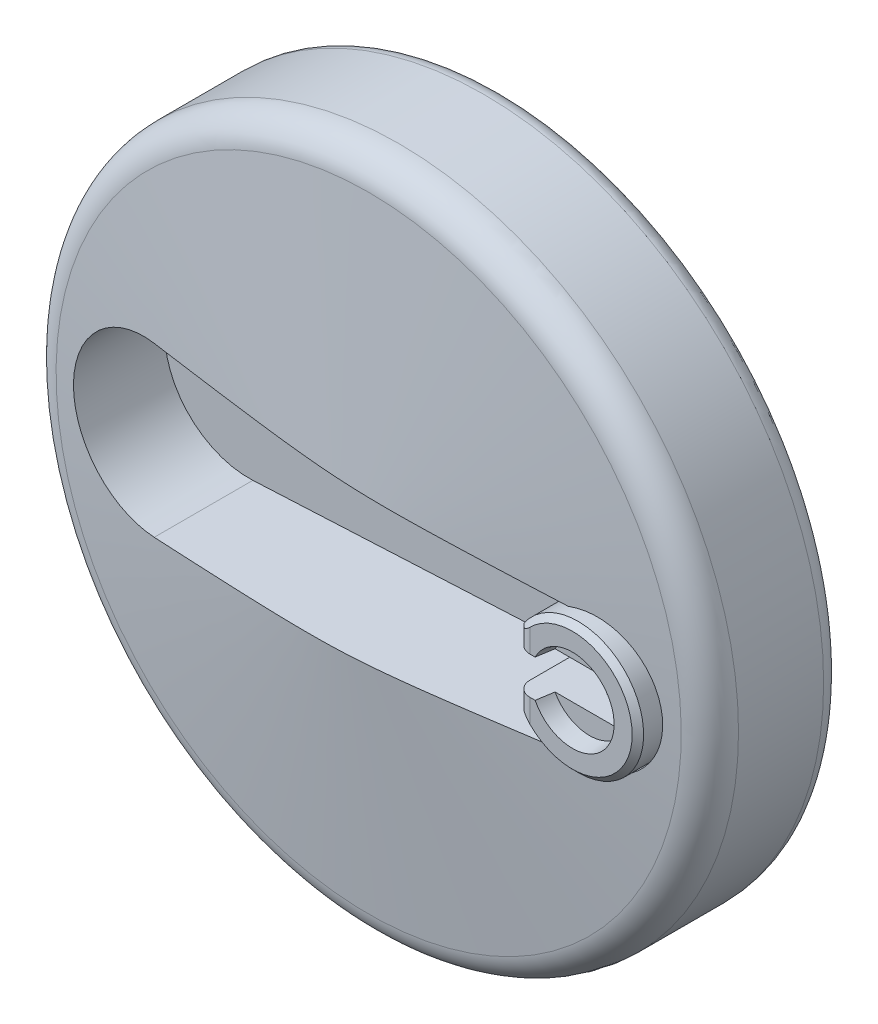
ISO-10303-21;
HEADER;
FILE_DESCRIPTION(('STEP AP214'),'2;1');
FILE_NAME('part.step','',(''),(''),'','','');
FILE_SCHEMA(('AUTOMOTIVE_DESIGN { 1 0 10303 214 1 1 1 1 }'));
ENDSEC;
DATA;
#1=APPLICATION_CONTEXT('core data for automotive mechanical design processes');
#2=APPLICATION_PROTOCOL_DEFINITION('international standard','automotive_design',2000,#1);
#3=PRODUCT_CONTEXT('',#1,'mechanical');
#4=PRODUCT('Part','Part','',(#3));
#5=PRODUCT_RELATED_PRODUCT_CATEGORY('part','',(#4));
#6=PRODUCT_DEFINITION_FORMATION('','',#4);
#7=PRODUCT_DEFINITION_CONTEXT('part definition',#1,'design');
#8=PRODUCT_DEFINITION('design','',#6,#7);
#9=PRODUCT_DEFINITION_SHAPE('','',#8);
#10=(LENGTH_UNIT() NAMED_UNIT(*) SI_UNIT(.MILLI.,.METRE.));
#11=(NAMED_UNIT(*) PLANE_ANGLE_UNIT() SI_UNIT($,.RADIAN.));
#12=(NAMED_UNIT(*) SI_UNIT($,.STERADIAN.) SOLID_ANGLE_UNIT());
#13=UNCERTAINTY_MEASURE_WITH_UNIT(LENGTH_MEASURE(1.E-05),#10,'distance_accuracy_value','');
#14=(GEOMETRIC_REPRESENTATION_CONTEXT(3) GLOBAL_UNCERTAINTY_ASSIGNED_CONTEXT((#13)) GLOBAL_UNIT_ASSIGNED_CONTEXT((#10,
#11,#12)) REPRESENTATION_CONTEXT('',''));
#15=CARTESIAN_POINT('',(0.,0.,0.));
#16=DIRECTION('',(0.,0.,1.));
#17=DIRECTION('',(1.,0.,0.));
#18=AXIS2_PLACEMENT_3D('',#15,#16,#17);
#19=CARTESIAN_POINT('',(28.,0.,24.0000000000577));
#20=DIRECTION('',(0.,0.,-1.));
#21=DIRECTION('',(0.,-1.,0.));
#22=AXIS2_PLACEMENT_3D('',#19,#20,#21);
#23=CONICAL_SURFACE('',#22,1.99999999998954,0.785398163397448);
#24=CARTESIAN_POINT('',(28.,0.,24.));
#25=DIRECTION('',(0.,0.,1.));
#26=DIRECTION('',(0.,1.,0.));
#27=AXIS2_PLACEMENT_3D('',#24,#25,#26);
#28=CIRCLE('',#27,2.0000000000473);
#29=CARTESIAN_POINT('',(28.,2.0000000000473,24.));
#30=VERTEX_POINT('',#29);
#31=EDGE_CURVE('E518',#30,#30,#28,.T.);
#32=ORIENTED_EDGE('',*,*,#31,.F.);
#33=EDGE_LOOP('',(#32));
#34=FACE_BOUND('',#33,.T.);
#35=CARTESIAN_POINT('',(28.,0.,24.3790000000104));
#36=DIRECTION('',(0.,0.,-1.));
#37=DIRECTION('',(-1.,0.,0.));
#38=AXIS2_PLACEMENT_3D('',#35,#36,#37);
#39=CIRCLE('',#38,1.62100000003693);
#40=CARTESIAN_POINT('',(26.3789999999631,0.,24.3790000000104));
#41=VERTEX_POINT('',#40);
#42=EDGE_CURVE('E196',#41,#41,#39,.T.);
#43=ORIENTED_EDGE('',*,*,#42,.F.);
#44=EDGE_LOOP('',(#43));
#45=FACE_BOUND('',#44,.T.);
#46=ADVANCED_FACE('F15',(#34,#45),#23,.F.);
#47=CARTESIAN_POINT('',(28.,0.,26.));
#48=DIRECTION('',(0.,0.,-1.));
#49=DIRECTION('',(0.,-1.,0.));
#50=AXIS2_PLACEMENT_3D('',#47,#48,#49);
#51=CYLINDRICAL_SURFACE('',#50,1.621);
#52=ORIENTED_EDGE('',*,*,#42,.T.);
#53=EDGE_LOOP('',(#52));
#54=FACE_BOUND('',#53,.T.);
#55=CARTESIAN_POINT('',(28.,0.,27.6210000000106));
#56=DIRECTION('',(0.,0.,1.));
#57=DIRECTION('',(-1.,0.,0.));
#58=AXIS2_PLACEMENT_3D('',#55,#56,#57);
#59=CIRCLE('',#58,1.62100000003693);
#60=CARTESIAN_POINT('',(26.3789999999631,0.,27.6210000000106));
#61=VERTEX_POINT('',#60);
#62=EDGE_CURVE('E141',#61,#61,#59,.T.);
#63=ORIENTED_EDGE('',*,*,#62,.T.);
#64=EDGE_LOOP('',(#63));
#65=FACE_BOUND('',#64,.T.);
#66=ADVANCED_FACE('F250',(#54,#65),#51,.F.);
#67=CARTESIAN_POINT('',(28.,0.,30.65));
#68=DIRECTION('',(0.,0.,-1.));
#69=DIRECTION('',(0.,-1.,0.));
#70=AXIS2_PLACEMENT_3D('',#67,#68,#69);
#71=CYLINDRICAL_SURFACE('',#70,8.);
#72=CARTESIAN_POINT('',(29.6,7.83836717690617,31.5675675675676));
#73=CARTESIAN_POINT('',(29.5999957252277,7.83836939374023,31.6563778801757));
#74=CARTESIAN_POINT('',(29.5925737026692,7.83989440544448,31.7452985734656));
#75=CARTESIAN_POINT('',(29.5630860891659,7.84582557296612,31.9206956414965));
#76=CARTESIAN_POINT('',(29.540991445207,7.85023744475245,32.0071668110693));
#77=CARTESIAN_POINT('',(29.4828692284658,7.86142276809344,32.1749958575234));
#78=CARTESIAN_POINT('',(29.4468618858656,7.86819278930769,32.2563609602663));
#79=CARTESIAN_POINT('',(29.3619853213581,7.88332705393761,32.411868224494));
#80=CARTESIAN_POINT('',(29.3131203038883,7.89169077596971,32.4860127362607));
#81=CARTESIAN_POINT('',(29.2031679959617,7.90920456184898,32.6260630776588));
#82=CARTESIAN_POINT('',(29.1419323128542,7.91836331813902,32.6918513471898));
#83=CARTESIAN_POINT('',(29.0092946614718,7.93635908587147,32.8122967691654));
#84=CARTESIAN_POINT('',(28.937891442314,7.9451960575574,32.8669525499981));
#85=CARTESIAN_POINT('',(28.786177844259,7.96164477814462,32.9640285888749));
#86=CARTESIAN_POINT('',(28.7057954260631,7.96924520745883,33.0063383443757));
#87=CARTESIAN_POINT('',(28.538885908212,7.9822678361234,33.0768077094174));
#88=CARTESIAN_POINT('',(28.4523594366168,7.98769025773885,33.1049687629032));
#89=CARTESIAN_POINT('',(28.2768269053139,7.99568512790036,33.1459790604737));
#90=CARTESIAN_POINT('',(28.1878685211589,7.99829417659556,33.1590251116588));
#91=CARTESIAN_POINT('',(28.0089898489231,8.00049473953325,33.1700490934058));
#92=CARTESIAN_POINT('',(27.9190696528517,8.00008653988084,33.1680284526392));
#93=CARTESIAN_POINT('',(27.7421731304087,7.99632696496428,33.1491257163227));
#94=CARTESIAN_POINT('',(27.6551731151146,7.99301759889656,33.1324557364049));
#95=CARTESIAN_POINT('',(27.4852300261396,7.98387487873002,33.0850637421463));
#96=CARTESIAN_POINT('',(27.4022871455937,7.97804140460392,33.0543410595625));
#97=CARTESIAN_POINT('',(27.2422059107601,7.9644364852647,32.9795181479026));
#98=CARTESIAN_POINT('',(27.1651076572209,7.95665299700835,32.9353344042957));
#99=CARTESIAN_POINT('',(27.0193468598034,7.94000685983,32.8349088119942));
#100=CARTESIAN_POINT('',(26.9506846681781,7.93114416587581,32.7786664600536));
#101=CARTESIAN_POINT('',(26.8224914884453,7.91313735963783,32.6545674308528));
#102=CARTESIAN_POINT('',(26.7631384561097,7.90399103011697,32.5865271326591));
#103=CARTESIAN_POINT('',(26.6566304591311,7.88658867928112,32.4413329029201));
#104=CARTESIAN_POINT('',(26.6094809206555,7.87833305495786,32.3641749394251));
#105=CARTESIAN_POINT('',(26.5286594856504,7.86364139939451,32.202658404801));
#106=CARTESIAN_POINT('',(26.4950274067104,7.85721076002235,32.1182794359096));
#107=CARTESIAN_POINT('',(26.4425364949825,7.84697610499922,31.9450179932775));
#108=CARTESIAN_POINT('',(26.4236465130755,7.84316655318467,31.856145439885));
#109=CARTESIAN_POINT('',(26.4082711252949,7.84005162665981,31.7334243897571));
#110=CARTESIAN_POINT('',(26.4051721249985,7.83942144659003,31.7003365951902));
#111=CARTESIAN_POINT('',(26.4010357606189,7.83857880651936,31.6340268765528));
#112=CARTESIAN_POINT('',(26.3999984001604,7.8383663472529,31.6008049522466));
#113=CARTESIAN_POINT('',(26.4000042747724,7.83836939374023,31.4787572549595));
#114=CARTESIAN_POINT('',(26.4074262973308,7.83989440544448,31.3898365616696));
#115=CARTESIAN_POINT('',(26.4369139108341,7.84582557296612,31.2144394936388));
#116=CARTESIAN_POINT('',(26.459008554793,7.85023744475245,31.1279683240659));
#117=CARTESIAN_POINT('',(26.5171307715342,7.86142276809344,30.9601392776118));
#118=CARTESIAN_POINT('',(26.5531381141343,7.86819278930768,30.878774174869));
#119=CARTESIAN_POINT('',(26.6380146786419,7.88332705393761,30.7232669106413));
#120=CARTESIAN_POINT('',(26.6868796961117,7.89169077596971,30.6491223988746));
#121=CARTESIAN_POINT('',(26.7968320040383,7.90920456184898,30.5090720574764));
#122=CARTESIAN_POINT('',(26.8580676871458,7.91836331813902,30.4432837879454));
#123=CARTESIAN_POINT('',(26.9907053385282,7.93635908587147,30.3228383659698));
#124=CARTESIAN_POINT('',(27.062108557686,7.9451960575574,30.2681825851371));
#125=CARTESIAN_POINT('',(27.213822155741,7.96164477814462,30.1711065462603));
#126=CARTESIAN_POINT('',(27.2942045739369,7.96924520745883,30.1287967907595));
#127=CARTESIAN_POINT('',(27.461114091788,7.9822678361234,30.0583274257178));
#128=CARTESIAN_POINT('',(27.5476405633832,7.98769025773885,30.030166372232));
#129=CARTESIAN_POINT('',(27.7231730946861,7.99568512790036,29.9891560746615));
#130=CARTESIAN_POINT('',(27.8121314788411,7.99829417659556,29.9761100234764));
#131=CARTESIAN_POINT('',(27.9910101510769,8.00049473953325,29.9650860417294));
#132=CARTESIAN_POINT('',(28.0809303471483,8.00008653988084,29.967106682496));
#133=CARTESIAN_POINT('',(28.2578268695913,7.99632696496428,29.9860094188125));
#134=CARTESIAN_POINT('',(28.3448268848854,7.99301759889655,30.0026793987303));
#135=CARTESIAN_POINT('',(28.5147699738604,7.98387487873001,30.0500713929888));
#136=CARTESIAN_POINT('',(28.5977128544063,7.97804140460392,30.0807940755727));
#137=CARTESIAN_POINT('',(28.7577940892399,7.9644364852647,30.1556169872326));
#138=CARTESIAN_POINT('',(28.8348923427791,7.95665299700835,30.1998007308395));
#139=CARTESIAN_POINT('',(28.9806531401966,7.94000685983,30.300226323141));
#140=CARTESIAN_POINT('',(29.0493153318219,7.93114416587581,30.3564686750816));
#141=CARTESIAN_POINT('',(29.1775085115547,7.91313735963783,30.4805677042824));
#142=CARTESIAN_POINT('',(29.2368615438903,7.90399103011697,30.5486080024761));
#143=CARTESIAN_POINT('',(29.3433695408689,7.88658867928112,30.6938022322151));
#144=CARTESIAN_POINT('',(29.3905190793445,7.87833305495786,30.7709601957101));
#145=CARTESIAN_POINT('',(29.4713405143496,7.86364139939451,30.9324767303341));
#146=CARTESIAN_POINT('',(29.5049725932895,7.85721076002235,31.0168556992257));
#147=CARTESIAN_POINT('',(29.5574635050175,7.84697610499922,31.1901171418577));
#148=CARTESIAN_POINT('',(29.5763534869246,7.84316655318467,31.2789896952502));
#149=CARTESIAN_POINT('',(29.5917288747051,7.84005162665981,31.4017107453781));
#150=CARTESIAN_POINT('',(29.5948278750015,7.83942144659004,31.434798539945));
#151=CARTESIAN_POINT('',(29.5989642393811,7.83857880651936,31.5011082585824));
#152=CARTESIAN_POINT('',(29.6000015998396,7.8383663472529,31.5343301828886));
#153=CARTESIAN_POINT('',(29.6,7.83836717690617,31.5675675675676));
#154=B_SPLINE_CURVE_WITH_KNOTS('',3,(#72,#73,#74,#75,#76,#77,#78,#79,#80,#81,#82,#83,#84,#85,
#86,#87,#88,#89,#90,#91,#92,#93,#94,#95,#96,#97,#98,#99,#100,#101,#102,#103,#104,#105,#106,#107,
#108,#109,#110,#111,#112,#113,#114,#115,#116,#117,#118,#119,#120,#121,#122,#123,#124,#125,#126,
#127,#128,#129,#130,#131,#132,#133,#134,#135,#136,#137,#138,#139,#140,#141,#142,#143,#144,#145,
#146,#147,#148,#149,#150,#151,#152,#153),.UNSPECIFIED.,.T.,.F.,(4,2,2,2,2,2,2,2,2,2,2,2,2,2,2,2,
2,2,2,2,2,2,2,2,2,2,2,2,2,2,2,2,2,2,2,2,2,2,2,2,4),(0.,0.266303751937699,0.533136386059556,
0.799582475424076,1.06594154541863,1.33570888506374,1.60550944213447,1.87765555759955,
2.14977389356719,2.41830777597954,2.68681619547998,2.95149963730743,3.21619566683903,
3.48256856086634,3.74895257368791,4.01993197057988,4.29103164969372,4.56292413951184,
4.83424057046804,4.93390494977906,5.03356950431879,5.29987325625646,5.56670589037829,
5.83315197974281,6.09951104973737,6.3692783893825,6.63907894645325,6.91122506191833,
7.18334339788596,7.45187728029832,7.72038569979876,7.98506914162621,8.24976517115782,
8.51613806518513,8.7825220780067,9.05350147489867,9.32460115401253,9.59649364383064,
9.86781007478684,9.96747445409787,10.0671390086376),.UNSPECIFIED.);
#155=CARTESIAN_POINT('',(29.6,7.83836717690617,31.5675675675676));
#156=VERTEX_POINT('',#155);
#157=EDGE_CURVE('E231',#156,#156,#154,.T.);
#158=ORIENTED_EDGE('',*,*,#157,.T.);
#159=EDGE_LOOP('',(#158));
#160=FACE_BOUND('',#159,.T.);
#161=CARTESIAN_POINT('',(21.3854268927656,4.49971361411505,37.3));
#162=CARTESIAN_POINT('',(21.3611186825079,4.46398733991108,37.2688460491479));
#163=CARTESIAN_POINT('',(21.3375430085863,4.42870188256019,37.2365745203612));
#164=CARTESIAN_POINT('',(21.2919472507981,4.35932799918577,37.1695025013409));
#165=CARTESIAN_POINT('',(21.2699317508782,4.32524323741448,37.1346951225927));
#166=CARTESIAN_POINT('',(21.2271401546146,4.2579341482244,37.0614976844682));
#167=CARTESIAN_POINT('',(21.2064107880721,4.22475481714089,37.0230382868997));
#168=CARTESIAN_POINT('',(21.1671165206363,4.16090210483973,36.9431236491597));
#169=CARTESIAN_POINT('',(21.1485490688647,4.13022578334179,36.9016720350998));
#170=CARTESIAN_POINT('',(21.111194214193,4.0676625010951,36.8087047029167));
#171=CARTESIAN_POINT('',(21.092827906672,4.03633854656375,36.7566295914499));
#172=CARTESIAN_POINT('',(21.0604254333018,3.98036944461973,36.6484532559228));
#173=CARTESIAN_POINT('',(21.0463433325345,3.95565381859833,36.5924033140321));
#174=CARTESIAN_POINT('',(21.0237726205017,3.91570759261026,36.4786073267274));
#175=CARTESIAN_POINT('',(21.0150693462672,3.90011453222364,36.421038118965));
#176=CARTESIAN_POINT('',(21.0061393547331,3.88406371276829,36.3323796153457));
#177=CARTESIAN_POINT('',(21.0038487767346,3.87993353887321,36.3021352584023));
#178=CARTESIAN_POINT('',(21.0007746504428,3.87438362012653,36.2412691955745));
#179=CARTESIAN_POINT('',(20.9999938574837,3.87296883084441,36.2106469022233));
#180=CARTESIAN_POINT('',(21.,3.87298334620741,36.18));
#181=B_SPLINE_CURVE_WITH_KNOTS('',3,(#161,#162,#163,#164,#165,#166,#167,#168,#169,#170,#171,
#172,#173,#174,#175,#176,#177,#178,#179,#180),.UNSPECIFIED.,.F.,.F.,(4,2,2,2,2,2,2,2,2,4),(0.,
0.159829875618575,0.320111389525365,0.484534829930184,0.648762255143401,0.838713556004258,
1.02654994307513,1.20630161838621,1.29798861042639,1.38984277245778),.UNSPECIFIED.);
#182=CARTESIAN_POINT('',(21.3854268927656,4.49971361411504,37.3));
#183=VERTEX_POINT('',#182);
#184=CARTESIAN_POINT('',(21.,3.87298334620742,36.18));
#185=VERTEX_POINT('',#184);
#186=EDGE_CURVE('E455',#183,#185,#181,.T.);
#187=ORIENTED_EDGE('',*,*,#186,.F.);
#188=CARTESIAN_POINT('',(28.,0.,37.3));
#189=DIRECTION('',(0.,0.,-1.));
#190=DIRECTION('',(0.,-1.,0.));
#191=AXIS2_PLACEMENT_3D('',#188,#189,#190);
#192=CIRCLE('',#191,8.);
#193=CARTESIAN_POINT('',(21.3854268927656,-4.49971361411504,37.3));
#194=VERTEX_POINT('',#193);
#195=EDGE_CURVE('E240',#183,#194,#192,.T.);
#196=ORIENTED_EDGE('',*,*,#195,.T.);
#197=CARTESIAN_POINT('',(21.,-3.87298334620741,36.18));
#198=CARTESIAN_POINT('',(20.9999958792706,-3.8729737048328,36.207562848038));
#199=CARTESIAN_POINT('',(21.0006265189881,-3.87411585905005,36.2351094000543));
#200=CARTESIAN_POINT('',(21.0031168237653,-3.8786126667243,36.2899285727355));
#201=CARTESIAN_POINT('',(21.0049748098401,-3.88196429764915,36.3172015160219));
#202=CARTESIAN_POINT('',(21.0122441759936,-3.89504420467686,36.3973946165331));
#203=CARTESIAN_POINT('',(21.0193544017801,-3.90780488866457,36.4496875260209));
#204=CARTESIAN_POINT('',(21.0401857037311,-3.94481264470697,36.5661627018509));
#205=CARTESIAN_POINT('',(21.0552301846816,-3.97132453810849,36.6293633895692));
#206=CARTESIAN_POINT('',(21.0906745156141,-4.03267717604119,36.7508812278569));
#207=CARTESIAN_POINT('',(21.1111424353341,-4.06762324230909,36.8091229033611));
#208=CARTESIAN_POINT('',(21.1509293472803,-4.13417101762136,36.9071214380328));
#209=CARTESIAN_POINT('',(21.1693987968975,-4.16464542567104,36.9480171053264));
#210=CARTESIAN_POINT('',(21.2084417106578,-4.22801629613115,37.0268870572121));
#211=CARTESIAN_POINT('',(21.2290173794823,-4.26091528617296,37.0648582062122));
#212=CARTESIAN_POINT('',(21.2713947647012,-4.32751466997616,37.1370401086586));
#213=CARTESIAN_POINT('',(21.2931453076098,-4.36116603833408,37.1713268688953));
#214=CARTESIAN_POINT('',(21.3381709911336,-4.42964143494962,37.2374343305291));
#215=CARTESIAN_POINT('',(21.3614420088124,-4.46446217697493,37.2692612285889));
#216=CARTESIAN_POINT('',(21.3854268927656,-4.49971361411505,37.3));
#217=B_SPLINE_CURVE_WITH_KNOTS('',3,(#197,#198,#199,#200,#201,#202,#203,#204,#205,#206,#207,
#208,#209,#210,#211,#212,#213,#214,#215,#216),.UNSPECIFIED.,.F.,.F.,(4,2,2,2,2,2,2,2,2,4),(0.,
0.0826282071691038,0.165143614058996,0.327223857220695,0.536584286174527,0.748708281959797,
0.91125442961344,1.07397249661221,1.23208581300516,1.3897868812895),.UNSPECIFIED.);
#218=CARTESIAN_POINT('',(21.,-3.87298334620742,36.18));
#219=VERTEX_POINT('',#218);
#220=EDGE_CURVE('E200',#219,#194,#217,.T.);
#221=ORIENTED_EDGE('',*,*,#220,.F.);
#222=DIRECTION('',(0.,0.,-1.));
#223=VECTOR('',#222,1.);
#224=CARTESIAN_POINT('',(21.,-3.87298334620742,36.18));
#225=LINE('',#224,#223);
#226=CARTESIAN_POINT('',(21.,-3.87298334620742,24.));
#227=VERTEX_POINT('',#226);
#228=EDGE_CURVE('E178',#219,#227,#225,.T.);
#229=ORIENTED_EDGE('',*,*,#228,.T.);
#230=CARTESIAN_POINT('',(28.,0.,24.));
#231=DIRECTION('',(0.,0.,1.));
#232=DIRECTION('',(0.,1.,0.));
#233=AXIS2_PLACEMENT_3D('',#230,#231,#232);
#234=CIRCLE('',#233,8.);
#235=CARTESIAN_POINT('',(21.7550020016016,-5.,24.));
#236=VERTEX_POINT('',#235);
#237=EDGE_CURVE('E526',#227,#236,#234,.T.);
#238=ORIENTED_EDGE('',*,*,#237,.T.);
#239=DIRECTION('',(0.,0.,-1.));
#240=VECTOR('',#239,1.);
#241=CARTESIAN_POINT('',(21.7550020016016,-5.,30.65));
#242=LINE('',#241,#240);
#243=CARTESIAN_POINT('',(21.7550020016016,-5.,25.7));
#244=VERTEX_POINT('',#243);
#245=EDGE_CURVE('E187',#236,#244,#242,.F.);
#246=ORIENTED_EDGE('',*,*,#245,.T.);
#247=CARTESIAN_POINT('',(28.,0.,25.7));
#248=DIRECTION('',(0.,0.,-1.));
#249=DIRECTION('',(0.,-1.,0.));
#250=AXIS2_PLACEMENT_3D('',#247,#248,#249);
#251=CIRCLE('',#250,8.);
#252=CARTESIAN_POINT('',(34.2449979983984,-5.,25.7));
#253=VERTEX_POINT('',#252);
#254=EDGE_CURVE('E190',#244,#253,#251,.F.);
#255=ORIENTED_EDGE('',*,*,#254,.T.);
#256=DIRECTION('',(0.,0.,-1.));
#257=VECTOR('',#256,1.);
#258=CARTESIAN_POINT('',(34.2449979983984,-5.,30.65));
#259=LINE('',#258,#257);
#260=CARTESIAN_POINT('',(34.2449979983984,-5.,24.));
#261=VERTEX_POINT('',#260);
#262=EDGE_CURVE('E192',#253,#261,#259,.T.);
#263=ORIENTED_EDGE('',*,*,#262,.T.);
#264=CARTESIAN_POINT('',(34.2449979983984,5.,24.));
#265=VERTEX_POINT('',#264);
#266=EDGE_CURVE('E530',#261,#265,#234,.T.);
#267=ORIENTED_EDGE('',*,*,#266,.T.);
#268=DIRECTION('',(0.,0.,1.));
#269=VECTOR('',#268,1.);
#270=CARTESIAN_POINT('',(34.2449979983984,5.,24.));
#271=LINE('',#270,#269);
#272=CARTESIAN_POINT('',(34.2449979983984,5.,25.7));
#273=VERTEX_POINT('',#272);
#274=EDGE_CURVE('E184',#265,#273,#271,.T.);
#275=ORIENTED_EDGE('',*,*,#274,.T.);
#276=CARTESIAN_POINT('',(28.,0.,25.7));
#277=DIRECTION('',(0.,0.,-1.));
#278=DIRECTION('',(0.,-1.,0.));
#279=AXIS2_PLACEMENT_3D('',#276,#277,#278);
#280=CIRCLE('',#279,8.);
#281=CARTESIAN_POINT('',(21.7550020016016,5.,25.7));
#282=VERTEX_POINT('',#281);
#283=EDGE_CURVE('E241',#273,#282,#280,.F.);
#284=ORIENTED_EDGE('',*,*,#283,.T.);
#285=DIRECTION('',(0.,0.,1.));
#286=VECTOR('',#285,1.);
#287=CARTESIAN_POINT('',(21.7550020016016,5.,24.));
#288=LINE('',#287,#286);
#289=CARTESIAN_POINT('',(21.7550020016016,5.,24.));
#290=VERTEX_POINT('',#289);
#291=EDGE_CURVE('E182',#282,#290,#288,.F.);
#292=ORIENTED_EDGE('',*,*,#291,.T.);
#293=CARTESIAN_POINT('',(21.,3.87298334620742,24.));
#294=VERTEX_POINT('',#293);
#295=EDGE_CURVE('E35',#290,#294,#234,.T.);
#296=ORIENTED_EDGE('',*,*,#295,.T.);
#297=DIRECTION('',(0.,0.,-1.));
#298=VECTOR('',#297,1.);
#299=CARTESIAN_POINT('',(21.,3.87298334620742,30.65));
#300=LINE('',#299,#298);
#301=EDGE_CURVE('E512',#294,#185,#300,.F.);
#302=ORIENTED_EDGE('',*,*,#301,.T.);
#303=EDGE_LOOP('',(#187,#196,#221,#229,#238,#246,#255,#263,#267,#275,#284,#292,#296,#302));
#304=FACE_BOUND('',#303,.T.);
#305=CARTESIAN_POINT('',(26.4,-7.83836717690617,31.5675675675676));
#306=CARTESIAN_POINT('',(26.4000042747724,-7.83836939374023,31.6563778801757));
#307=CARTESIAN_POINT('',(26.4074262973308,-7.83989440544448,31.7452985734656));
#308=CARTESIAN_POINT('',(26.4369139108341,-7.84582557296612,31.9206956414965));
#309=CARTESIAN_POINT('',(26.459008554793,-7.85023744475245,32.0071668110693));
#310=CARTESIAN_POINT('',(26.5171307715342,-7.86142276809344,32.1749958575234));
#311=CARTESIAN_POINT('',(26.5531381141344,-7.86819278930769,32.2563609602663));
#312=CARTESIAN_POINT('',(26.6380146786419,-7.88332705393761,32.411868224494));
#313=CARTESIAN_POINT('',(26.6868796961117,-7.89169077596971,32.4860127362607));
#314=CARTESIAN_POINT('',(26.7968320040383,-7.90920456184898,32.6260630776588));
#315=CARTESIAN_POINT('',(26.8580676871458,-7.91836331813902,32.6918513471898));
#316=CARTESIAN_POINT('',(26.9907053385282,-7.93635908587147,32.8122967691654));
#317=CARTESIAN_POINT('',(27.0621085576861,-7.94519605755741,32.8669525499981));
#318=CARTESIAN_POINT('',(27.213822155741,-7.96164477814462,32.9640285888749));
#319=CARTESIAN_POINT('',(27.2942045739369,-7.96924520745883,33.0063383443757));
#320=CARTESIAN_POINT('',(27.461114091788,-7.9822678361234,33.0768077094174));
#321=CARTESIAN_POINT('',(27.5476405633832,-7.98769025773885,33.1049687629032));
#322=CARTESIAN_POINT('',(27.7231730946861,-7.99568512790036,33.1459790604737));
#323=CARTESIAN_POINT('',(27.8121314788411,-7.99829417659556,33.1590251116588));
#324=CARTESIAN_POINT('',(27.9910101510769,-8.00049473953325,33.1700490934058));
#325=CARTESIAN_POINT('',(28.0809303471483,-8.00008653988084,33.1680284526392));
#326=CARTESIAN_POINT('',(28.2578268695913,-7.99632696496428,33.1491257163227));
#327=CARTESIAN_POINT('',(28.3448268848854,-7.99301759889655,33.1324557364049));
#328=CARTESIAN_POINT('',(28.5147699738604,-7.98387487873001,33.0850637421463));
#329=CARTESIAN_POINT('',(28.5977128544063,-7.97804140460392,33.0543410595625));
#330=CARTESIAN_POINT('',(28.7577940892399,-7.9644364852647,32.9795181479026));
#331=CARTESIAN_POINT('',(28.8348923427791,-7.95665299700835,32.9353344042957));
#332=CARTESIAN_POINT('',(28.9806531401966,-7.94000685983,32.8349088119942));
#333=CARTESIAN_POINT('',(29.0493153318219,-7.93114416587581,32.7786664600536));
#334=CARTESIAN_POINT('',(29.1775085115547,-7.91313735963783,32.6545674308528));
#335=CARTESIAN_POINT('',(29.2368615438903,-7.90399103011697,32.5865271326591));
#336=CARTESIAN_POINT('',(29.3433695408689,-7.88658867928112,32.4413329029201));
#337=CARTESIAN_POINT('',(29.3905190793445,-7.87833305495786,32.3641749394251));
#338=CARTESIAN_POINT('',(29.4713405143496,-7.86364139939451,32.2026584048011));
#339=CARTESIAN_POINT('',(29.5049725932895,-7.85721076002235,32.1182794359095));
#340=CARTESIAN_POINT('',(29.5574635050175,-7.84697610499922,31.9450179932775));
#341=CARTESIAN_POINT('',(29.5763534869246,-7.84316655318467,31.856145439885));
#342=CARTESIAN_POINT('',(29.5917288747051,-7.84005162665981,31.7334243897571));
#343=CARTESIAN_POINT('',(29.5948278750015,-7.83942144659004,31.7003365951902));
#344=CARTESIAN_POINT('',(29.5989642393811,-7.83857880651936,31.6340268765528));
#345=CARTESIAN_POINT('',(29.6000015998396,-7.8383663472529,31.6008049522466));
#346=CARTESIAN_POINT('',(29.5999957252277,-7.83836939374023,31.4787572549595));
#347=CARTESIAN_POINT('',(29.5925737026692,-7.83989440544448,31.3898365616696));
#348=CARTESIAN_POINT('',(29.5630860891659,-7.84582557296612,31.2144394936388));
#349=CARTESIAN_POINT('',(29.540991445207,-7.85023744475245,31.1279683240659));
#350=CARTESIAN_POINT('',(29.4828692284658,-7.86142276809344,30.9601392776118));
#351=CARTESIAN_POINT('',(29.4468618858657,-7.86819278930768,30.878774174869));
#352=CARTESIAN_POINT('',(29.3619853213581,-7.8833270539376,30.7232669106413));
#353=CARTESIAN_POINT('',(29.3131203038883,-7.89169077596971,30.6491223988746));
#354=CARTESIAN_POINT('',(29.2031679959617,-7.90920456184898,30.5090720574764));
#355=CARTESIAN_POINT('',(29.1419323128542,-7.91836331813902,30.4432837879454));
#356=CARTESIAN_POINT('',(29.0092946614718,-7.93635908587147,30.3228383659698));
#357=CARTESIAN_POINT('',(28.937891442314,-7.9451960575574,30.2681825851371));
#358=CARTESIAN_POINT('',(28.786177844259,-7.96164477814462,30.1711065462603));
#359=CARTESIAN_POINT('',(28.7057954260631,-7.96924520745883,30.1287967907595));
#360=CARTESIAN_POINT('',(28.538885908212,-7.9822678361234,30.0583274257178));
#361=CARTESIAN_POINT('',(28.4523594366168,-7.98769025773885,30.030166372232));
#362=CARTESIAN_POINT('',(28.2768269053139,-7.99568512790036,29.9891560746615));
#363=CARTESIAN_POINT('',(28.1878685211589,-7.99829417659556,29.9761100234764));
#364=CARTESIAN_POINT('',(28.0089898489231,-8.00049473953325,29.9650860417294));
#365=CARTESIAN_POINT('',(27.9190696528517,-8.00008653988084,29.967106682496));
#366=CARTESIAN_POINT('',(27.7421731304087,-7.99632696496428,29.9860094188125));
#367=CARTESIAN_POINT('',(27.6551731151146,-7.99301759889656,30.0026793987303));
#368=CARTESIAN_POINT('',(27.4852300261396,-7.98387487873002,30.0500713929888));
#369=CARTESIAN_POINT('',(27.4022871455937,-7.97804140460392,30.0807940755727));
#370=CARTESIAN_POINT('',(27.2422059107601,-7.9644364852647,30.1556169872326));
#371=CARTESIAN_POINT('',(27.1651076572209,-7.95665299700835,30.1998007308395));
#372=CARTESIAN_POINT('',(27.0193468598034,-7.94000685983,30.300226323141));
#373=CARTESIAN_POINT('',(26.9506846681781,-7.93114416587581,30.3564686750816));
#374=CARTESIAN_POINT('',(26.8224914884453,-7.91313735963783,30.4805677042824));
#375=CARTESIAN_POINT('',(26.7631384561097,-7.90399103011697,30.5486080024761));
#376=CARTESIAN_POINT('',(26.6566304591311,-7.88658867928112,30.6938022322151));
#377=CARTESIAN_POINT('',(26.6094809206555,-7.87833305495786,30.7709601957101));
#378=CARTESIAN_POINT('',(26.5286594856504,-7.86364139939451,30.9324767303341));
#379=CARTESIAN_POINT('',(26.4950274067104,-7.85721076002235,31.0168556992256));
#380=CARTESIAN_POINT('',(26.4425364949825,-7.84697610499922,31.1901171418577));
#381=CARTESIAN_POINT('',(26.4236465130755,-7.84316655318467,31.2789896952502));
#382=CARTESIAN_POINT('',(26.4082711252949,-7.84005162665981,31.4017107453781));
#383=CARTESIAN_POINT('',(26.4051721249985,-7.83942144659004,31.434798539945));
#384=CARTESIAN_POINT('',(26.4010357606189,-7.83857880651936,31.5011082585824));
#385=CARTESIAN_POINT('',(26.3999984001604,-7.8383663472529,31.5343301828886));
#386=CARTESIAN_POINT('',(26.4,-7.83836717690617,31.5675675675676));
#387=B_SPLINE_CURVE_WITH_KNOTS('',3,(#305,#306,#307,#308,#309,#310,#311,#312,#313,#314,#315,
#316,#317,#318,#319,#320,#321,#322,#323,#324,#325,#326,#327,#328,#329,#330,#331,#332,#333,#334,
#335,#336,#337,#338,#339,#340,#341,#342,#343,#344,#345,#346,#347,#348,#349,#350,#351,#352,#353,
#354,#355,#356,#357,#358,#359,#360,#361,#362,#363,#364,#365,#366,#367,#368,#369,#370,#371,#372,
#373,#374,#375,#376,#377,#378,#379,#380,#381,#382,#383,#384,#385,#386),.UNSPECIFIED.,.T.,.F.,(4,
2,2,2,2,2,2,2,2,2,2,2,2,2,2,2,2,2,2,2,2,2,2,2,2,2,2,2,2,2,2,2,2,2,2,2,2,2,2,2,4),(0.,
0.266303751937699,0.533136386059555,0.799582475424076,1.06594154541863,1.33570888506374,
1.60550944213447,1.87765555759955,2.14977389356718,2.41830777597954,2.68681619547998,
2.95149963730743,3.21619566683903,3.48256856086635,3.74895257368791,4.01993197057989,
4.29103164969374,4.56292413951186,4.83424057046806,4.93390494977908,5.03356950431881,
5.29987325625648,5.56670589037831,5.83315197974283,6.09951104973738,6.36927838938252,
6.63907894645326,6.91122506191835,7.18334339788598,7.45187728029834,7.72038569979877,
7.98506914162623,8.24976517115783,8.51613806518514,8.78252207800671,9.05350147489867,
9.32460115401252,9.59649364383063,9.86781007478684,9.96747445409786,10.0671390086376),.UNSPECIFIED.);
#388=CARTESIAN_POINT('',(26.4,-7.83836717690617,31.5675675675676));
#389=VERTEX_POINT('',#388);
#390=EDGE_CURVE('E191',#389,#389,#387,.T.);
#391=ORIENTED_EDGE('',*,*,#390,.T.);
#392=EDGE_LOOP('',(#391));
#393=FACE_BOUND('',#392,.T.);
#394=ADVANCED_FACE('F246',(#160,#304,#393),#71,.T.);
#395=CARTESIAN_POINT('',(28.,16.,31.5675675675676));
#396=DIRECTION('',(0.,1.,0.));
#397=DIRECTION('',(-1.,0.,0.));
#398=AXIS2_PLACEMENT_3D('',#395,#396,#397);
#399=CYLINDRICAL_SURFACE('',#398,1.6);
#400=CARTESIAN_POINT('',(28.,7.6,31.5675675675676));
#401=DIRECTION('',(0.,1.,0.));
#402=DIRECTION('',(-1.,0.,0.));
#403=AXIS2_PLACEMENT_3D('',#400,#401,#402);
#404=CIRCLE('',#403,1.6);
#405=CARTESIAN_POINT('',(26.4,7.6,31.5675675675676));
#406=VERTEX_POINT('',#405);
#407=EDGE_CURVE('E505',#406,#406,#404,.T.);
#408=ORIENTED_EDGE('',*,*,#407,.F.);
#409=EDGE_LOOP('',(#408));
#410=FACE_BOUND('',#409,.T.);
#411=ORIENTED_EDGE('',*,*,#157,.F.);
#412=EDGE_LOOP('',(#411));
#413=FACE_BOUND('',#412,.T.);
#414=ADVANCED_FACE('F243',(#410,#413),#399,.F.);
#415=CARTESIAN_POINT('',(22.82,16.,36.18));
#416=DIRECTION('',(0.,1.,0.));
#417=DIRECTION('',(-1.,0.,0.));
#418=AXIS2_PLACEMENT_3D('',#415,#416,#417);
#419=CYLINDRICAL_SURFACE('',#418,1.82);
#420=ORIENTED_EDGE('',*,*,#186,.T.);
#421=DIRECTION('',(0.,1.,0.));
#422=VECTOR('',#421,1.);
#423=CARTESIAN_POINT('',(21.,16.,36.18));
#424=LINE('',#423,#422);
#425=CARTESIAN_POINT('',(21.,2.28571428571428,36.18));
#426=VERTEX_POINT('',#425);
#427=EDGE_CURVE('E175',#185,#426,#424,.F.);
#428=ORIENTED_EDGE('',*,*,#427,.T.);
#429=CARTESIAN_POINT('',(22.82,2.28571428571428,36.18));
#430=DIRECTION('',(0.,1.,0.));
#431=DIRECTION('',(-1.,0.,0.));
#432=AXIS2_PLACEMENT_3D('',#429,#430,#431);
#433=CIRCLE('',#432,1.82);
#434=CARTESIAN_POINT('',(22.82,2.28571428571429,38.));
#435=VERTEX_POINT('',#434);
#436=EDGE_CURVE('E210',#426,#435,#433,.T.);
#437=ORIENTED_EDGE('',*,*,#436,.T.);
#438=DIRECTION('',(0.,1.,0.));
#439=VECTOR('',#438,1.);
#440=CARTESIAN_POINT('',(22.82,0.,38.));
#441=LINE('',#440,#439);
#442=CARTESIAN_POINT('',(22.82,5.14369516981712,38.));
#443=VERTEX_POINT('',#442);
#444=EDGE_CURVE('E451',#443,#435,#441,.F.);
#445=ORIENTED_EDGE('',*,*,#444,.F.);
#446=CARTESIAN_POINT('',(21.3854268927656,4.49971361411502,37.3));
#447=CARTESIAN_POINT('',(21.4000946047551,4.48787715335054,37.3187845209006));
#448=CARTESIAN_POINT('',(21.4153868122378,4.47688445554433,37.3376117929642));
#449=CARTESIAN_POINT('',(21.4472740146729,4.45683186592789,37.3752560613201));
#450=CARTESIAN_POINT('',(21.4638713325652,4.44777553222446,37.3940729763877));
#451=CARTESIAN_POINT('',(21.5154350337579,4.42402564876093,37.4500615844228));
#452=CARTESIAN_POINT('',(21.5523287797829,4.41261971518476,37.4869738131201));
#453=CARTESIAN_POINT('',(21.6237990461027,4.4010987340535,37.5523925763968));
#454=CARTESIAN_POINT('',(21.6577798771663,4.39945166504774,37.5812910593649));
#455=CARTESIAN_POINT('',(21.727464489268,4.40323261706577,37.6362738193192));
#456=CARTESIAN_POINT('',(21.7631655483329,4.40864979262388,37.6623623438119));
#457=CARTESIAN_POINT('',(21.8439176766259,4.42771829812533,37.7170677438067));
#458=CARTESIAN_POINT('',(21.8891662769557,4.44302657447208,37.744801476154));
#459=CARTESIAN_POINT('',(21.9795413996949,4.48091064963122,37.7951550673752));
#460=CARTESIAN_POINT('',(22.0246669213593,4.50351200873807,37.8177564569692));
#461=CARTESIAN_POINT('',(22.1417649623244,4.56948823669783,37.8707762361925));
#462=CARTESIAN_POINT('',(22.2130628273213,4.61706130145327,37.8973715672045));
#463=CARTESIAN_POINT('',(22.3529727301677,4.72008521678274,37.9405876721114));
#464=CARTESIAN_POINT('',(22.4215743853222,4.77556331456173,37.957172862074));
#465=CARTESIAN_POINT('',(22.5461583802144,4.88265663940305,37.9802229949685));
#466=CARTESIAN_POINT('',(22.6025028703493,4.93362371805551,37.987824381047));
#467=CARTESIAN_POINT('',(22.712820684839,5.03741216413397,37.9976667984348));
#468=CARTESIAN_POINT('',(22.766812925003,5.09020786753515,37.9999642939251));
#469=CARTESIAN_POINT('',(22.82,5.14369516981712,38.));
#470=B_SPLINE_CURVE_WITH_KNOTS('',3,(#446,#447,#448,#449,#450,#451,#452,#453,#454,#455,#456,
#457,#458,#459,#460,#461,#462,#463,#464,#465,#466,#467,#468,#469),.UNSPECIFIED.,.F.,.F.,(4,2,2,
2,2,2,2,2,2,2,2,4),(0.,0.0797968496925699,0.159739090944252,0.318774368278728,0.451999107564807,
0.585019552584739,0.749794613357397,0.915153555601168,1.18288453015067,1.45156171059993,
1.68037511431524,1.90674115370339),.UNSPECIFIED.);
#471=EDGE_CURVE('E462',#183,#443,#470,.T.);
#472=ORIENTED_EDGE('',*,*,#471,.F.);
#473=EDGE_LOOP('',(#420,#428,#437,#445,#472));
#474=FACE_BOUND('',#473,.T.);
#475=ADVANCED_FACE('F396',(#474),#419,.T.);
#476=CARTESIAN_POINT('',(28.,0.,37.3));
#477=DIRECTION('',(0.,0.,-1.));
#478=DIRECTION('',(0.,-1.,0.));
#479=AXIS2_PLACEMENT_3D('',#476,#477,#478);
#480=CONICAL_SURFACE('',#479,8.,0.785398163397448);
#481=ORIENTED_EDGE('',*,*,#471,.T.);
#482=CARTESIAN_POINT('',(28.,0.,38.));
#483=DIRECTION('',(0.,0.,-1.));
#484=DIRECTION('',(0.,-1.,0.));
#485=AXIS2_PLACEMENT_3D('',#482,#483,#484);
#486=CIRCLE('',#485,7.3);
#487=CARTESIAN_POINT('',(22.82,-5.14369516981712,38.));
#488=VERTEX_POINT('',#487);
#489=EDGE_CURVE('E446',#443,#488,#486,.T.);
#490=ORIENTED_EDGE('',*,*,#489,.T.);
#491=CARTESIAN_POINT('',(22.82,-5.14369516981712,38.));
#492=CARTESIAN_POINT('',(22.7762484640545,-5.09966836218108,37.9999837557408));
#493=CARTESIAN_POINT('',(22.7319485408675,-5.05613969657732,37.9984212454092));
#494=CARTESIAN_POINT('',(22.6420170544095,-4.97041214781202,37.991844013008));
#495=CARTESIAN_POINT('',(22.5963811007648,-4.92821889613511,37.9868162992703));
#496=CARTESIAN_POINT('',(22.5030840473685,-4.84513381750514,37.9728257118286));
#497=CARTESIAN_POINT('',(22.4554016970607,-4.80427637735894,37.9637972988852));
#498=CARTESIAN_POINT('',(22.3587434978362,-4.72554228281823,37.9412787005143));
#499=CARTESIAN_POINT('',(22.3097699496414,-4.68766074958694,37.9277960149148));
#500=CARTESIAN_POINT('',(22.2142550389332,-4.61885364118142,37.8969140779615));
#501=CARTESIAN_POINT('',(22.1678178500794,-4.58761682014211,37.8798976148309));
#502=CARTESIAN_POINT('',(22.0739775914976,-4.53032040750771,37.8408499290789));
#503=CARTESIAN_POINT('',(22.0265777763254,-4.50424581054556,37.8188336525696));
#504=CARTESIAN_POINT('',(21.938051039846,-4.46258352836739,37.7726972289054));
#505=CARTESIAN_POINT('',(21.8969983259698,-4.44602860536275,37.7493303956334));
#506=CARTESIAN_POINT('',(21.8153259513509,-4.41999217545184,37.6983331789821));
#507=CARTESIAN_POINT('',(21.7747055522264,-4.41049561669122,37.6707120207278));
#508=CARTESIAN_POINT('',(21.6947628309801,-4.40002559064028,37.6113407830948));
#509=CARTESIAN_POINT('',(21.6554559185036,-4.39913146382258,37.5795550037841));
#510=CARTESIAN_POINT('',(21.580050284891,-4.40666247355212,37.5132109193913));
#511=CARTESIAN_POINT('',(21.5439587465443,-4.41510793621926,37.4786467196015));
#512=CARTESIAN_POINT('',(21.4872112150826,-4.43629868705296,37.4198265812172));
#513=CARTESIAN_POINT('',(21.4653439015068,-4.44676297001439,37.3958607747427));
#514=CARTESIAN_POINT('',(21.4237837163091,-4.47094093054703,37.3478970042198));
#515=CARTESIAN_POINT('',(21.404081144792,-4.48463916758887,37.3238997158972));
#516=CARTESIAN_POINT('',(21.3854268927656,-4.49971361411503,37.3));
#517=B_SPLINE_CURVE_WITH_KNOTS('',3,(#491,#492,#493,#494,#495,#496,#497,#498,#499,#500,#501,
#502,#503,#504,#505,#506,#507,#508,#509,#510,#511,#512,#513,#514,#515,#516),.UNSPECIFIED.,.F.,
.F.,(4,2,2,2,2,2,2,2,2,2,2,2,4),(0.,0.186233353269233,0.373168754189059,0.563286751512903,
0.753086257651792,0.928230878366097,1.10285866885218,1.25246795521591,1.40175727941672,
1.55242219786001,1.7034156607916,1.80546729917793,1.90704120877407),.UNSPECIFIED.);
#518=EDGE_CURVE('E224',#488,#194,#517,.T.);
#519=ORIENTED_EDGE('',*,*,#518,.T.);
#520=ORIENTED_EDGE('',*,*,#195,.F.);
#521=EDGE_LOOP('',(#481,#490,#519,#520));
#522=FACE_BOUND('',#521,.T.);
#523=ADVANCED_FACE('F424',(#522),#480,.T.);
#524=CARTESIAN_POINT('',(22.82,16.,36.18));
#525=DIRECTION('',(0.,1.,0.));
#526=DIRECTION('',(-1.,0.,0.));
#527=AXIS2_PLACEMENT_3D('',#524,#525,#526);
#528=CYLINDRICAL_SURFACE('',#527,1.82);
#529=ORIENTED_EDGE('',*,*,#518,.F.);
#530=DIRECTION('',(0.,1.,0.));
#531=VECTOR('',#530,1.);
#532=CARTESIAN_POINT('',(22.82,0.,38.));
#533=LINE('',#532,#531);
#534=CARTESIAN_POINT('',(22.82,-2.28571428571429,38.));
#535=VERTEX_POINT('',#534);
#536=EDGE_CURVE('E440',#535,#488,#533,.F.);
#537=ORIENTED_EDGE('',*,*,#536,.F.);
#538=CARTESIAN_POINT('',(22.82,-2.28571428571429,36.18));
#539=DIRECTION('',(0.,1.,0.));
#540=DIRECTION('',(-1.,0.,0.));
#541=AXIS2_PLACEMENT_3D('',#538,#539,#540);
#542=CIRCLE('',#541,1.82);
#543=CARTESIAN_POINT('',(21.,-2.28571428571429,36.18));
#544=VERTEX_POINT('',#543);
#545=EDGE_CURVE('E467',#535,#544,#542,.F.);
#546=ORIENTED_EDGE('',*,*,#545,.T.);
#547=DIRECTION('',(0.,1.,0.));
#548=VECTOR('',#547,1.);
#549=CARTESIAN_POINT('',(21.,16.,36.18));
#550=LINE('',#549,#548);
#551=EDGE_CURVE('E197',#544,#219,#550,.F.);
#552=ORIENTED_EDGE('',*,*,#551,.T.);
#553=ORIENTED_EDGE('',*,*,#220,.T.);
#554=EDGE_LOOP('',(#529,#537,#546,#552,#553));
#555=FACE_BOUND('',#554,.T.);
#556=ADVANCED_FACE('F298',(#555),#528,.T.);
#557=CARTESIAN_POINT('',(21.,16.,36.18));
#558=DIRECTION('',(1.,0.,0.));
#559=DIRECTION('',(0.,0.,-1.));
#560=AXIS2_PLACEMENT_3D('',#557,#558,#559);
#561=PLANE('',#560);
#562=DIRECTION('',(0.,1.,0.));
#563=VECTOR('',#562,1.);
#564=CARTESIAN_POINT('',(21.,16.,28.));
#565=LINE('',#564,#563);
#566=CARTESIAN_POINT('',(21.,2.28571428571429,28.));
#567=VERTEX_POINT('',#566);
#568=CARTESIAN_POINT('',(21.,-2.28571428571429,28.));
#569=VERTEX_POINT('',#568);
#570=EDGE_CURVE('E174',#567,#569,#565,.F.);
#571=ORIENTED_EDGE('',*,*,#570,.F.);
#572=DIRECTION('',(0.,0.,-1.));
#573=VECTOR('',#572,1.);
#574=CARTESIAN_POINT('',(21.,2.28571428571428,36.18));
#575=LINE('',#574,#573);
#576=EDGE_CURVE('E159',#426,#567,#575,.T.);
#577=ORIENTED_EDGE('',*,*,#576,.F.);
#578=ORIENTED_EDGE('',*,*,#427,.F.);
#579=ORIENTED_EDGE('',*,*,#301,.F.);
#580=DIRECTION('',(0.,1.,0.));
#581=VECTOR('',#580,1.);
#582=CARTESIAN_POINT('',(21.,0.,24.));
#583=LINE('',#582,#581);
#584=EDGE_CURVE('E521',#227,#294,#583,.T.);
#585=ORIENTED_EDGE('',*,*,#584,.F.);
#586=ORIENTED_EDGE('',*,*,#228,.F.);
#587=ORIENTED_EDGE('',*,*,#551,.F.);
#588=DIRECTION('',(0.,0.,-1.));
#589=VECTOR('',#588,1.);
#590=CARTESIAN_POINT('',(21.,-2.28571428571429,36.18));
#591=LINE('',#590,#589);
#592=EDGE_CURVE('E459',#569,#544,#591,.F.);
#593=ORIENTED_EDGE('',*,*,#592,.F.);
#594=EDGE_LOOP('',(#571,#577,#578,#579,#585,#586,#587,#593));
#595=FACE_BOUND('',#594,.T.);
#596=ADVANCED_FACE('F332',(#595),#561,.F.);
#597=CARTESIAN_POINT('',(12.,-5.,25.7));
#598=DIRECTION('',(0.,1.,0.));
#599=DIRECTION('',(-1.,0.,0.));
#600=AXIS2_PLACEMENT_3D('',#597,#598,#599);
#601=PLANE('',#600);
#602=DIRECTION('',(-1.,0.,0.));
#603=VECTOR('',#602,1.);
#604=CARTESIAN_POINT('',(12.,-5.,25.7));
#605=LINE('',#604,#603);
#606=EDGE_CURVE('E185',#244,#253,#605,.F.);
#607=ORIENTED_EDGE('',*,*,#606,.F.);
#608=ORIENTED_EDGE('',*,*,#245,.F.);
#609=DIRECTION('',(-1.,0.,0.));
#610=VECTOR('',#609,1.);
#611=CARTESIAN_POINT('',(0.,-5.,24.));
#612=LINE('',#611,#610);
#613=EDGE_CURVE('E523',#261,#236,#612,.T.);
#614=ORIENTED_EDGE('',*,*,#613,.F.);
#615=ORIENTED_EDGE('',*,*,#262,.F.);
#616=EDGE_LOOP('',(#607,#608,#614,#615));
#617=FACE_BOUND('',#616,.T.);
#618=ADVANCED_FACE('F329',(#617),#601,.F.);
#619=CARTESIAN_POINT('',(12.,-10.,25.7));
#620=DIRECTION('',(0.,0.,1.));
#621=DIRECTION('',(0.,1.,0.));
#622=AXIS2_PLACEMENT_3D('',#619,#620,#621);
#623=PLANE('',#622);
#624=ORIENTED_EDGE('',*,*,#606,.T.);
#625=ORIENTED_EDGE('',*,*,#254,.F.);
#626=EDGE_LOOP('',(#624,#625));
#627=FACE_BOUND('',#626,.T.);
#628=ADVANCED_FACE('F285',(#627),#623,.F.);
#629=CARTESIAN_POINT('',(12.,5.,24.));
#630=DIRECTION('',(0.,-1.,0.));
#631=DIRECTION('',(1.,0.,0.));
#632=AXIS2_PLACEMENT_3D('',#629,#630,#631);
#633=PLANE('',#632);
#634=DIRECTION('',(1.,0.,0.));
#635=VECTOR('',#634,1.);
#636=CARTESIAN_POINT('',(0.,5.,24.));
#637=LINE('',#636,#635);
#638=EDGE_CURVE('E527',#290,#265,#637,.T.);
#639=ORIENTED_EDGE('',*,*,#638,.F.);
#640=ORIENTED_EDGE('',*,*,#291,.F.);
#641=DIRECTION('',(-1.,0.,0.));
#642=VECTOR('',#641,1.);
#643=CARTESIAN_POINT('',(12.,5.,25.7));
#644=LINE('',#643,#642);
#645=EDGE_CURVE('E181',#282,#273,#644,.F.);
#646=ORIENTED_EDGE('',*,*,#645,.T.);
#647=ORIENTED_EDGE('',*,*,#274,.F.);
#648=EDGE_LOOP('',(#639,#640,#646,#647));
#649=FACE_BOUND('',#648,.T.);
#650=ADVANCED_FACE('F325',(#649),#633,.F.);
#651=CARTESIAN_POINT('',(12.,5.,25.7));
#652=DIRECTION('',(0.,0.,1.));
#653=DIRECTION('',(0.,1.,0.));
#654=AXIS2_PLACEMENT_3D('',#651,#652,#653);
#655=PLANE('',#654);
#656=ORIENTED_EDGE('',*,*,#645,.F.);
#657=ORIENTED_EDGE('',*,*,#283,.F.);
#658=EDGE_LOOP('',(#656,#657));
#659=FACE_BOUND('',#658,.T.);
#660=ADVANCED_FACE('F283',(#659),#655,.F.);
#661=CARTESIAN_POINT('',(28.,16.,31.5675675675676));
#662=DIRECTION('',(0.,1.,0.));
#663=DIRECTION('',(-1.,0.,0.));
#664=AXIS2_PLACEMENT_3D('',#661,#662,#663);
#665=CYLINDRICAL_SURFACE('',#664,1.6);
#666=CARTESIAN_POINT('',(28.,-7.6,31.5675675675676));
#667=DIRECTION('',(0.,1.,0.));
#668=DIRECTION('',(-1.,0.,0.));
#669=AXIS2_PLACEMENT_3D('',#666,#667,#668);
#670=CIRCLE('',#669,1.6);
#671=CARTESIAN_POINT('',(26.4,-7.6,31.5675675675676));
#672=VERTEX_POINT('',#671);
#673=EDGE_CURVE('E225',#672,#672,#670,.F.);
#674=ORIENTED_EDGE('',*,*,#673,.F.);
#675=EDGE_LOOP('',(#674));
#676=FACE_BOUND('',#675,.T.);
#677=ORIENTED_EDGE('',*,*,#390,.F.);
#678=EDGE_LOOP('',(#677));
#679=FACE_BOUND('',#678,.T.);
#680=ADVANCED_FACE('F278',(#676,#679),#665,.F.);
#681=CARTESIAN_POINT('',(28.,0.,28.));
#682=DIRECTION('',(0.,0.,1.));
#683=DIRECTION('',(0.,1.,0.));
#684=AXIS2_PLACEMENT_3D('',#681,#682,#683);
#685=PLANE('',#684);
#686=CARTESIAN_POINT('',(31.0857142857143,1.37142857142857,28.));
#687=DIRECTION('',(0.,0.,-1.));
#688=DIRECTION('',(0.,-1.,0.));
#689=AXIS2_PLACEMENT_3D('',#686,#687,#688);
#690=CIRCLE('',#689,0.914285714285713);
#691=CARTESIAN_POINT('',(32.,1.37142857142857,28.));
#692=VERTEX_POINT('',#691);
#693=CARTESIAN_POINT('',(31.0857142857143,2.28571428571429,28.));
#694=VERTEX_POINT('',#693);
#695=EDGE_CURVE('E128',#692,#694,#690,.F.);
#696=ORIENTED_EDGE('',*,*,#695,.T.);
#697=DIRECTION('',(-1.,0.,0.));
#698=VECTOR('',#697,1.);
#699=CARTESIAN_POINT('',(28.,2.28571428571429,28.));
#700=LINE('',#699,#698);
#701=EDGE_CURVE('E136',#694,#567,#700,.T.);
#702=ORIENTED_EDGE('',*,*,#701,.T.);
#703=ORIENTED_EDGE('',*,*,#570,.T.);
#704=DIRECTION('',(1.,0.,0.));
#705=VECTOR('',#704,1.);
#706=CARTESIAN_POINT('',(31.0857142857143,-2.28571428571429,28.));
#707=LINE('',#706,#705);
#708=CARTESIAN_POINT('',(31.0857142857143,-2.28571428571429,28.));
#709=VERTEX_POINT('',#708);
#710=EDGE_CURVE('E208',#569,#709,#707,.T.);
#711=ORIENTED_EDGE('',*,*,#710,.T.);
#712=CARTESIAN_POINT('',(31.0857142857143,-1.37142857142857,28.));
#713=DIRECTION('',(0.,0.,-1.));
#714=DIRECTION('',(0.,-1.,0.));
#715=AXIS2_PLACEMENT_3D('',#712,#713,#714);
#716=CIRCLE('',#715,0.914285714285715);
#717=CARTESIAN_POINT('',(32.,-1.37142857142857,28.));
#718=VERTEX_POINT('',#717);
#719=EDGE_CURVE('E165',#709,#718,#716,.F.);
#720=ORIENTED_EDGE('',*,*,#719,.T.);
#721=DIRECTION('',(0.,1.,0.));
#722=VECTOR('',#721,1.);
#723=CARTESIAN_POINT('',(32.,0.,28.));
#724=LINE('',#723,#722);
#725=EDGE_CURVE('E140',#718,#692,#724,.T.);
#726=ORIENTED_EDGE('',*,*,#725,.T.);
#727=EDGE_LOOP('',(#696,#702,#703,#711,#720,#726));
#728=FACE_BOUND('',#727,.T.);
#729=CARTESIAN_POINT('',(28.,0.,28.00000000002));
#730=DIRECTION('',(0.,0.,1.));
#731=DIRECTION('',(0.,1.,0.));
#732=AXIS2_PLACEMENT_3D('',#729,#730,#731);
#733=CIRCLE('',#732,2.00000000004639);
#734=CARTESIAN_POINT('',(28.,2.00000000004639,28.00000000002));
#735=VERTEX_POINT('',#734);
#736=EDGE_CURVE('E218',#735,#735,#733,.F.);
#737=ORIENTED_EDGE('',*,*,#736,.T.);
#738=EDGE_LOOP('',(#737));
#739=FACE_BOUND('',#738,.T.);
#740=ADVANCED_FACE('F133',(#728,#739),#685,.T.);
#741=CARTESIAN_POINT('',(16.,2.28571428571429,28.));
#742=DIRECTION('',(0.,1.,0.));
#743=DIRECTION('',(-1.,0.,0.));
#744=AXIS2_PLACEMENT_3D('',#741,#742,#743);
#745=PLANE('',#744);
#746=CARTESIAN_POINT('',(23.4463291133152,2.28571428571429,38.0000000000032));
#747=CARTESIAN_POINT('',(23.5013619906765,2.28571428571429,37.6499304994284));
#748=CARTESIAN_POINT('',(23.5566141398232,2.28571428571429,37.2998957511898));
#749=CARTESIAN_POINT('',(23.6675569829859,2.28571428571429,36.5998957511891));
#750=CARTESIAN_POINT('',(23.7232476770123,2.28571428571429,36.2499304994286));
#751=CARTESIAN_POINT('',(23.7791576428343,2.28571428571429,35.9000000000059));
#752=B_SPLINE_CURVE_WITH_KNOTS('',3,(#746,#747,#748,#749,#750,#751),.UNSPECIFIED.,.F.,.F.,(4,2,
4),(0.,1.06310588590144,2.12621179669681),.UNSPECIFIED.);
#753=CARTESIAN_POINT('',(23.4463291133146,2.28571428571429,38.000000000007));
#754=VERTEX_POINT('',#753);
#755=CARTESIAN_POINT('',(23.7791576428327,2.28571428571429,35.9000000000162));
#756=VERTEX_POINT('',#755);
#757=EDGE_CURVE('E152',#754,#756,#752,.T.);
#758=ORIENTED_EDGE('',*,*,#757,.F.);
#759=DIRECTION('',(-1.,0.,0.));
#760=VECTOR('',#759,1.);
#761=CARTESIAN_POINT('',(21.8024321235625,2.28571428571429,38.));
#762=LINE('',#761,#760);
#763=EDGE_CURVE('E453',#435,#754,#762,.F.);
#764=ORIENTED_EDGE('',*,*,#763,.F.);
#765=ORIENTED_EDGE('',*,*,#436,.F.);
#766=ORIENTED_EDGE('',*,*,#576,.T.);
#767=ORIENTED_EDGE('',*,*,#701,.F.);
#768=DIRECTION('',(0.,0.,1.));
#769=VECTOR('',#768,1.);
#770=CARTESIAN_POINT('',(31.0857142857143,2.28571428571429,28.));
#771=LINE('',#770,#769);
#772=CARTESIAN_POINT('',(31.0857142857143,2.28571428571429,35.9));
#773=VERTEX_POINT('',#772);
#774=EDGE_CURVE('E145',#773,#694,#771,.F.);
#775=ORIENTED_EDGE('',*,*,#774,.F.);
#776=DIRECTION('',(-1.,0.,0.));
#777=VECTOR('',#776,1.);
#778=CARTESIAN_POINT('',(16.,2.28571428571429,35.9));
#779=LINE('',#778,#777);
#780=EDGE_CURVE('E216',#756,#773,#779,.F.);
#781=ORIENTED_EDGE('',*,*,#780,.F.);
#782=EDGE_LOOP('',(#758,#764,#765,#766,#767,#775,#781));
#783=FACE_BOUND('',#782,.T.);
#784=CARTESIAN_POINT('',(28.,2.28571428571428,31.5675675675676));
#785=DIRECTION('',(0.,-1.,0.));
#786=DIRECTION('',(1.,0.,0.));
#787=AXIS2_PLACEMENT_3D('',#784,#785,#786);
#788=CIRCLE('',#787,1.6);
#789=CARTESIAN_POINT('',(29.6,2.28571428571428,31.5675675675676));
#790=VERTEX_POINT('',#789);
#791=EDGE_CURVE('E153',#790,#790,#788,.T.);
#792=ORIENTED_EDGE('',*,*,#791,.F.);
#793=EDGE_LOOP('',(#792));
#794=FACE_BOUND('',#793,.T.);
#795=ADVANCED_FACE('F156',(#783,#794),#745,.F.);
#796=CARTESIAN_POINT('',(31.0857142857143,-2.28571428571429,28.));
#797=DIRECTION('',(0.,-1.,0.));
#798=DIRECTION('',(1.,0.,0.));
#799=AXIS2_PLACEMENT_3D('',#796,#797,#798);
#800=PLANE('',#799);
#801=DIRECTION('',(0.,0.,1.));
#802=VECTOR('',#801,1.);
#803=CARTESIAN_POINT('',(31.0857142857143,-2.28571428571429,28.));
#804=LINE('',#803,#802);
#805=CARTESIAN_POINT('',(31.0857142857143,-2.28571428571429,35.9));
#806=VERTEX_POINT('',#805);
#807=EDGE_CURVE('E205',#709,#806,#804,.T.);
#808=ORIENTED_EDGE('',*,*,#807,.F.);
#809=ORIENTED_EDGE('',*,*,#710,.F.);
#810=ORIENTED_EDGE('',*,*,#592,.T.);
#811=ORIENTED_EDGE('',*,*,#545,.F.);
#812=DIRECTION('',(-1.,0.,0.));
#813=VECTOR('',#812,1.);
#814=CARTESIAN_POINT('',(21.8024321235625,-2.28571428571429,38.));
#815=LINE('',#814,#813);
#816=CARTESIAN_POINT('',(23.4463291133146,-2.28571428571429,38.000000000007));
#817=VERTEX_POINT('',#816);
#818=EDGE_CURVE('E450',#817,#535,#815,.T.);
#819=ORIENTED_EDGE('',*,*,#818,.F.);
#820=CARTESIAN_POINT('',(23.7791576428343,-2.28571428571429,35.9000000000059));
#821=CARTESIAN_POINT('',(23.7232476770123,-2.28571428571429,36.2499304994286));
#822=CARTESIAN_POINT('',(23.6675569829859,-2.28571428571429,36.5998957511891));
#823=CARTESIAN_POINT('',(23.5566141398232,-2.28571428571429,37.2998957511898));
#824=CARTESIAN_POINT('',(23.5013619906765,-2.28571428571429,37.6499304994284));
#825=CARTESIAN_POINT('',(23.4463291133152,-2.28571428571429,38.0000000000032));
#826=B_SPLINE_CURVE_WITH_KNOTS('',3,(#820,#821,#822,#823,#824,#825),.UNSPECIFIED.,.F.,.F.,(4,2,
4),(0.,1.06310591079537,2.12621179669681),.UNSPECIFIED.);
#827=CARTESIAN_POINT('',(23.7791576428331,-2.28571428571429,35.9000000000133));
#828=VERTEX_POINT('',#827);
#829=EDGE_CURVE('E163',#828,#817,#826,.T.);
#830=ORIENTED_EDGE('',*,*,#829,.F.);
#831=DIRECTION('',(1.,0.,0.));
#832=VECTOR('',#831,1.);
#833=CARTESIAN_POINT('',(31.0857142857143,-2.28571428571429,35.9));
#834=LINE('',#833,#832);
#835=EDGE_CURVE('E207',#806,#828,#834,.F.);
#836=ORIENTED_EDGE('',*,*,#835,.F.);
#837=EDGE_LOOP('',(#808,#809,#810,#811,#819,#830,#836));
#838=FACE_BOUND('',#837,.T.);
#839=CARTESIAN_POINT('',(28.,-2.28571428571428,31.5675675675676));
#840=DIRECTION('',(0.,-1.,0.));
#841=DIRECTION('',(1.,0.,0.));
#842=AXIS2_PLACEMENT_3D('',#839,#840,#841);
#843=CIRCLE('',#842,1.6);
#844=CARTESIAN_POINT('',(29.6,-2.28571428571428,31.5675675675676));
#845=VERTEX_POINT('',#844);
#846=EDGE_CURVE('E160',#845,#845,#843,.F.);
#847=ORIENTED_EDGE('',*,*,#846,.F.);
#848=EDGE_LOOP('',(#847));
#849=FACE_BOUND('',#848,.T.);
#850=ADVANCED_FACE('F324',(#838,#849),#800,.F.);
#851=CARTESIAN_POINT('',(28.,7.60000000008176,31.5675675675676));
#852=DIRECTION('',(0.,-1.,0.));
#853=DIRECTION('',(1.,0.,0.));
#854=AXIS2_PLACEMENT_3D('',#851,#852,#853);
#855=CONICAL_SURFACE('',#854,1.59999999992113,0.785398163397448);
#856=CARTESIAN_POINT('',(28.,7.99999999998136,31.5675675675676));
#857=DIRECTION('',(0.,-1.,0.));
#858=DIRECTION('',(1.,0.,0.));
#859=AXIS2_PLACEMENT_3D('',#856,#857,#858);
#860=CIRCLE('',#859,1.20000000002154);
#861=CARTESIAN_POINT('',(29.2000000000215,7.99999999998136,31.5675675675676));
#862=VERTEX_POINT('',#861);
#863=EDGE_CURVE('E275',#862,#862,#860,.T.);
#864=ORIENTED_EDGE('',*,*,#863,.T.);
#865=EDGE_LOOP('',(#864));
#866=FACE_BOUND('',#865,.T.);
#867=ORIENTED_EDGE('',*,*,#407,.T.);
#868=EDGE_LOOP('',(#867));
#869=FACE_BOUND('',#868,.T.);
#870=ADVANCED_FACE('F393',(#866,#869),#855,.T.);
#871=CARTESIAN_POINT('',(21.8024321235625,0.,38.));
#872=DIRECTION('',(0.,0.,1.));
#873=DIRECTION('',(0.,1.,0.));
#874=AXIS2_PLACEMENT_3D('',#871,#872,#873);
#875=PLANE('',#874);
#876=ORIENTED_EDGE('',*,*,#763,.T.);
#877=CARTESIAN_POINT('',(28.,0.,38.0000000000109));
#878=DIRECTION('',(0.,0.,1.));
#879=DIRECTION('',(0.,1.,0.));
#880=AXIS2_PLACEMENT_3D('',#877,#878,#879);
#881=CIRCLE('',#880,5.09513575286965);
#882=EDGE_CURVE('E483',#754,#817,#881,.F.);
#883=ORIENTED_EDGE('',*,*,#882,.T.);
#884=ORIENTED_EDGE('',*,*,#818,.T.);
#885=ORIENTED_EDGE('',*,*,#536,.T.);
#886=ORIENTED_EDGE('',*,*,#489,.F.);
#887=ORIENTED_EDGE('',*,*,#444,.T.);
#888=EDGE_LOOP('',(#876,#883,#884,#885,#886,#887));
#889=FACE_BOUND('',#888,.T.);
#890=ADVANCED_FACE('F384',(#889),#875,.T.);
#891=CARTESIAN_POINT('',(28.,-7.60000000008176,31.5675675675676));
#892=DIRECTION('',(0.,1.,0.));
#893=DIRECTION('',(-1.,0.,0.));
#894=AXIS2_PLACEMENT_3D('',#891,#892,#893);
#895=CONICAL_SURFACE('',#894,1.59999999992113,0.785398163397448);
#896=ORIENTED_EDGE('',*,*,#673,.T.);
#897=EDGE_LOOP('',(#896));
#898=FACE_BOUND('',#897,.T.);
#899=CARTESIAN_POINT('',(28.,-7.99999999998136,31.5675675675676));
#900=DIRECTION('',(0.,1.,0.));
#901=DIRECTION('',(-1.,0.,0.));
#902=AXIS2_PLACEMENT_3D('',#899,#900,#901);
#903=CIRCLE('',#902,1.20000000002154);
#904=CARTESIAN_POINT('',(26.7999999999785,-7.99999999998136,31.5675675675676));
#905=VERTEX_POINT('',#904);
#906=EDGE_CURVE('E142',#905,#905,#903,.T.);
#907=ORIENTED_EDGE('',*,*,#906,.T.);
#908=EDGE_LOOP('',(#907));
#909=FACE_BOUND('',#908,.T.);
#910=ADVANCED_FACE('F378',(#898,#909),#895,.T.);
#911=CARTESIAN_POINT('',(31.0857142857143,1.37142857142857,28.));
#912=DIRECTION('',(0.,0.,-1.));
#913=DIRECTION('',(0.,-1.,0.));
#914=AXIS2_PLACEMENT_3D('',#911,#912,#913);
#915=CYLINDRICAL_SURFACE('',#914,0.914285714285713);
#916=ORIENTED_EDGE('',*,*,#774,.T.);
#917=ORIENTED_EDGE('',*,*,#695,.F.);
#918=DIRECTION('',(0.,0.,1.));
#919=VECTOR('',#918,1.);
#920=CARTESIAN_POINT('',(32.,1.37142857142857,28.));
#921=LINE('',#920,#919);
#922=CARTESIAN_POINT('',(32.,1.37142857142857,35.9));
#923=VERTEX_POINT('',#922);
#924=EDGE_CURVE('E212',#692,#923,#921,.T.);
#925=ORIENTED_EDGE('',*,*,#924,.T.);
#926=CARTESIAN_POINT('',(31.0857142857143,1.37142857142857,35.9));
#927=DIRECTION('',(0.,0.,-1.));
#928=DIRECTION('',(0.,-1.,0.));
#929=AXIS2_PLACEMENT_3D('',#926,#927,#928);
#930=CIRCLE('',#929,0.914285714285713);
#931=EDGE_CURVE('E148',#773,#923,#930,.T.);
#932=ORIENTED_EDGE('',*,*,#931,.F.);
#933=EDGE_LOOP('',(#916,#917,#925,#932));
#934=FACE_BOUND('',#933,.T.);
#935=ADVANCED_FACE('F146',(#934),#915,.F.);
#936=CARTESIAN_POINT('',(31.0857142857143,-1.37142857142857,28.));
#937=DIRECTION('',(0.,0.,-1.));
#938=DIRECTION('',(0.,-1.,0.));
#939=AXIS2_PLACEMENT_3D('',#936,#937,#938);
#940=CYLINDRICAL_SURFACE('',#939,0.914285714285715);
#941=DIRECTION('',(0.,0.,-1.));
#942=VECTOR('',#941,1.);
#943=CARTESIAN_POINT('',(32.,-1.37142857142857,28.));
#944=LINE('',#943,#942);
#945=CARTESIAN_POINT('',(32.,-1.37142857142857,35.9));
#946=VERTEX_POINT('',#945);
#947=EDGE_CURVE('E214',#718,#946,#944,.F.);
#948=ORIENTED_EDGE('',*,*,#947,.F.);
#949=ORIENTED_EDGE('',*,*,#719,.F.);
#950=ORIENTED_EDGE('',*,*,#807,.T.);
#951=CARTESIAN_POINT('',(31.0857142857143,-1.37142857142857,35.9));
#952=DIRECTION('',(0.,0.,-1.));
#953=DIRECTION('',(0.,-1.,0.));
#954=AXIS2_PLACEMENT_3D('',#951,#952,#953);
#955=CIRCLE('',#954,0.914285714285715);
#956=EDGE_CURVE('E201',#946,#806,#955,.T.);
#957=ORIENTED_EDGE('',*,*,#956,.F.);
#958=EDGE_LOOP('',(#948,#949,#950,#957));
#959=FACE_BOUND('',#958,.T.);
#960=ADVANCED_FACE('F391',(#959),#940,.F.);
#961=CARTESIAN_POINT('',(32.,1.37142857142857,28.));
#962=DIRECTION('',(1.,0.,0.));
#963=DIRECTION('',(0.,1.,0.));
#964=AXIS2_PLACEMENT_3D('',#961,#962,#963);
#965=PLANE('',#964);
#966=ORIENTED_EDGE('',*,*,#924,.F.);
#967=ORIENTED_EDGE('',*,*,#725,.F.);
#968=ORIENTED_EDGE('',*,*,#947,.T.);
#969=DIRECTION('',(0.,1.,0.));
#970=VECTOR('',#969,1.);
#971=CARTESIAN_POINT('',(32.,0.,35.9));
#972=LINE('',#971,#970);
#973=EDGE_CURVE('E202',#923,#946,#972,.F.);
#974=ORIENTED_EDGE('',*,*,#973,.F.);
#975=EDGE_LOOP('',(#966,#967,#968,#974));
#976=FACE_BOUND('',#975,.T.);
#977=ADVANCED_FACE('F408',(#976),#965,.F.);
#978=CARTESIAN_POINT('',(28.,0.,28.00000000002));
#979=DIRECTION('',(0.,0.,1.));
#980=DIRECTION('',(0.,1.,0.));
#981=AXIS2_PLACEMENT_3D('',#978,#979,#980);
#982=CONICAL_SURFACE('',#981,2.00000000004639,0.785398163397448);
#983=ORIENTED_EDGE('',*,*,#736,.F.);
#984=EDGE_LOOP('',(#983));
#985=FACE_BOUND('',#984,.T.);
#986=ORIENTED_EDGE('',*,*,#62,.F.);
#987=EDGE_LOOP('',(#986));
#988=FACE_BOUND('',#987,.T.);
#989=ADVANCED_FACE('F296',(#985,#988),#982,.F.);
#990=CARTESIAN_POINT('',(28.,0.,37.999999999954));
#991=DIRECTION('',(0.,0.,1.));
#992=DIRECTION('',(0.,1.,0.));
#993=AXIS2_PLACEMENT_3D('',#990,#991,#992);
#994=CONICAL_SURFACE('',#993,5.09513575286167,0.139626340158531);
#995=CARTESIAN_POINT('',(28.,0.,35.9000000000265));
#996=DIRECTION('',(0.,0.,1.));
#997=DIRECTION('',(0.,1.,0.));
#998=AXIS2_PLACEMENT_3D('',#995,#996,#997);
#999=CIRCLE('',#998,4.79999999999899);
#1000=EDGE_CURVE('E228',#828,#756,#999,.T.);
#1001=ORIENTED_EDGE('',*,*,#1000,.F.);
#1002=ORIENTED_EDGE('',*,*,#829,.T.);
#1003=ORIENTED_EDGE('',*,*,#882,.F.);
#1004=ORIENTED_EDGE('',*,*,#757,.T.);
#1005=EDGE_LOOP('',(#1001,#1002,#1003,#1004));
#1006=FACE_BOUND('',#1005,.T.);
#1007=ADVANCED_FACE('F292',(#1006),#994,.F.);
#1008=CARTESIAN_POINT('',(25.6,0.,35.9));
#1009=DIRECTION('',(0.,0.,1.));
#1010=DIRECTION('',(0.,1.,0.));
#1011=AXIS2_PLACEMENT_3D('',#1008,#1009,#1010);
#1012=PLANE('',#1011);
#1013=ORIENTED_EDGE('',*,*,#973,.T.);
#1014=ORIENTED_EDGE('',*,*,#956,.T.);
#1015=ORIENTED_EDGE('',*,*,#835,.T.);
#1016=ORIENTED_EDGE('',*,*,#1000,.T.);
#1017=ORIENTED_EDGE('',*,*,#780,.T.);
#1018=ORIENTED_EDGE('',*,*,#931,.T.);
#1019=EDGE_LOOP('',(#1013,#1014,#1015,#1016,#1017,#1018));
#1020=FACE_BOUND('',#1019,.T.);
#1021=ADVANCED_FACE('F295',(#1020),#1012,.T.);
#1022=CARTESIAN_POINT('',(28.,0.,31.5675675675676));
#1023=DIRECTION('',(0.,-1.,0.));
#1024=DIRECTION('',(1.,0.,0.));
#1025=AXIS2_PLACEMENT_3D('',#1022,#1023,#1024);
#1026=CYLINDRICAL_SURFACE('',#1025,1.6);
#1027=ORIENTED_EDGE('',*,*,#846,.T.);
#1028=EDGE_LOOP('',(#1027));
#1029=FACE_BOUND('',#1028,.T.);
#1030=ORIENTED_EDGE('',*,*,#791,.T.);
#1031=EDGE_LOOP('',(#1030));
#1032=FACE_BOUND('',#1031,.T.);
#1033=ADVANCED_FACE('F290',(#1029,#1032),#1026,.T.);
#1034=CARTESIAN_POINT('',(28.,8.,32.1675675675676));
#1035=DIRECTION('',(0.,1.,0.));
#1036=DIRECTION('',(-1.,0.,0.));
#1037=AXIS2_PLACEMENT_3D('',#1034,#1035,#1036);
#1038=PLANE('',#1037);
#1039=ORIENTED_EDGE('',*,*,#863,.F.);
#1040=EDGE_LOOP('',(#1039));
#1041=FACE_BOUND('',#1040,.T.);
#1042=ADVANCED_FACE('F286',(#1041),#1038,.T.);
#1043=CARTESIAN_POINT('',(28.,-8.,32.1675675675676));
#1044=DIRECTION('',(0.,-1.,0.));
#1045=DIRECTION('',(1.,0.,0.));
#1046=AXIS2_PLACEMENT_3D('',#1043,#1044,#1045);
#1047=PLANE('',#1046);
#1048=ORIENTED_EDGE('',*,*,#906,.F.);
#1049=EDGE_LOOP('',(#1048));
#1050=FACE_BOUND('',#1049,.T.);
#1051=ADVANCED_FACE('F17',(#1050),#1047,.T.);
#1052=CARTESIAN_POINT('',(0.,0.,24.));
#1053=DIRECTION('',(0.,0.,1.));
#1054=DIRECTION('',(0.,1.,0.));
#1055=AXIS2_PLACEMENT_3D('',#1052,#1053,#1054);
#1056=PLANE('',#1055);
#1057=ORIENTED_EDGE('',*,*,#31,.T.);
#1058=EDGE_LOOP('',(#1057));
#1059=FACE_BOUND('',#1058,.T.);
#1060=ADVANCED_FACE('F354',(#1059),#1056,.T.);
#1061=CARTESIAN_POINT('',(-25.54,0.,24.));
#1062=DIRECTION('',(0.,0.,1.));
#1063=DIRECTION('',(0.,1.,0.));
#1064=AXIS2_PLACEMENT_3D('',#1061,#1062,#1063);
#1065=CIRCLE('',#1064,10.27);
#1066=CARTESIAN_POINT('',(-25.0335973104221,10.2575073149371,24.));
#1067=VERTEX_POINT('',#1066);
#1068=CARTESIAN_POINT('',(-25.0335973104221,-10.2575073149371,24.));
#1069=VERTEX_POINT('',#1068);
#1070=EDGE_CURVE('E731',#1067,#1069,#1065,.T.);
#1071=ORIENTED_EDGE('',*,*,#1070,.T.);
#1072=DIRECTION('',(0.998783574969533,0.0493089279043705,0.));
#1073=VECTOR('',#1072,1.);
#1074=CARTESIAN_POINT('',(-25.0335973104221,-10.2575073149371,24.));
#1075=LINE('',#1074,#1073);
#1076=CARTESIAN_POINT('',(25.5725080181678,-7.7591354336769,24.));
#1077=VERTEX_POINT('',#1076);
#1078=EDGE_CURVE('E1176',#1069,#1077,#1075,.T.);
#1079=ORIENTED_EDGE('',*,*,#1078,.T.);
#1080=CARTESIAN_POINT('',(28.,0.,24.));
#1081=DIRECTION('',(0.,0.,-1.));
#1082=DIRECTION('',(0.,-1.,0.));
#1083=AXIS2_PLACEMENT_3D('',#1080,#1081,#1082);
#1084=CIRCLE('',#1083,8.13);
#1085=CARTESIAN_POINT('',(25.5725080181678,7.7591354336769,24.));
#1086=VERTEX_POINT('',#1085);
#1087=EDGE_CURVE('E727',#1077,#1086,#1084,.F.);
#1088=ORIENTED_EDGE('',*,*,#1087,.T.);
#1089=DIRECTION('',(-0.998783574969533,0.0493089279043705,0.));
#1090=VECTOR('',#1089,1.);
#1091=CARTESIAN_POINT('',(28.3762271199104,7.62071867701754,24.));
#1092=LINE('',#1091,#1090);
#1093=EDGE_CURVE('E733',#1086,#1067,#1092,.T.);
#1094=ORIENTED_EDGE('',*,*,#1093,.T.);
#1095=EDGE_LOOP('',(#1071,#1079,#1088,#1094));
#1096=FACE_BOUND('',#1095,.T.);
#1097=ORIENTED_EDGE('',*,*,#237,.F.);
#1098=ORIENTED_EDGE('',*,*,#584,.T.);
#1099=ORIENTED_EDGE('',*,*,#295,.F.);
#1100=ORIENTED_EDGE('',*,*,#638,.T.);
#1101=ORIENTED_EDGE('',*,*,#266,.F.);
#1102=ORIENTED_EDGE('',*,*,#613,.T.);
#1103=EDGE_LOOP('',(#1097,#1098,#1099,#1100,#1101,#1102));
#1104=FACE_BOUND('',#1103,.T.);
#1105=ADVANCED_FACE('F355',(#1096,#1104),#1056,.T.);
#1106=CARTESIAN_POINT('',(-25.54,0.,54.));
#1107=DIRECTION('',(0.,0.,1.));
#1108=DIRECTION('',(0.,1.,0.));
#1109=AXIS2_PLACEMENT_3D('',#1106,#1107,#1108);
#1110=CYLINDRICAL_SURFACE('',#1109,10.27);
#1111=ORIENTED_EDGE('',*,*,#1070,.F.);
#1112=DIRECTION('',(0.,0.,1.));
#1113=VECTOR('',#1112,1.);
#1114=CARTESIAN_POINT('',(-25.0335973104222,10.2575073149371,54.));
#1115=LINE('',#1114,#1113);
#1116=CARTESIAN_POINT('',(-25.0335973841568,10.2575073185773,36.0463788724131));
#1117=VERTEX_POINT('',#1116);
#1118=EDGE_CURVE('E730',#1067,#1117,#1115,.T.);
#1119=ORIENTED_EDGE('',*,*,#1118,.T.);
#1120=CARTESIAN_POINT('',(-25.0335973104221,-10.2575073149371,36.0463788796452));
#1121=CARTESIAN_POINT('',(-25.2021120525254,-10.2658277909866,36.0298502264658));
#1122=CARTESIAN_POINT('',(-25.3708246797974,-10.269992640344,36.0134483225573));
#1123=CARTESIAN_POINT('',(-25.7085496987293,-10.270007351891,35.9808930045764));
#1124=CARTESIAN_POINT('',(-25.8775621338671,-10.2658437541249,35.964740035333));
#1125=CARTESIAN_POINT('',(-26.3348096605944,-10.2432673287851,35.9213974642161));
#1126=CARTESIAN_POINT('',(-26.6227151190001,-10.2168517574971,35.8944927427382));
#1127=CARTESIAN_POINT('',(-27.1954784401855,-10.1398153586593,35.8416650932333));
#1128=CARTESIAN_POINT('',(-27.4803346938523,-10.089182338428,35.815742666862));
#1129=CARTESIAN_POINT('',(-28.045242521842,-9.96395814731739,35.7649600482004));
#1130=CARTESIAN_POINT('',(-28.3252871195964,-9.8893348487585,35.7401013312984));
#1131=CARTESIAN_POINT('',(-28.8781630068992,-9.71665807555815,35.6915794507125));
#1132=CARTESIAN_POINT('',(-29.1509942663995,-9.61860450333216,35.6679162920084));
#1133=CARTESIAN_POINT('',(-29.6873559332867,-9.39979716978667,35.6218834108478));
#1134=CARTESIAN_POINT('',(-29.9508907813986,-9.27905442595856,35.599513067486));
#1135=CARTESIAN_POINT('',(-30.4669102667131,-9.01567354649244,35.5561318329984));
#1136=CARTESIAN_POINT('',(-30.7193945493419,-8.8730347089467,35.5351209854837));
#1137=CARTESIAN_POINT('',(-31.2113825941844,-8.56692616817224,35.494539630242));
#1138=CARTESIAN_POINT('',(-31.4508915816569,-8.40346494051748,35.4749685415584));
#1139=CARTESIAN_POINT('',(-31.9153059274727,-8.05681910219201,35.437322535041));
#1140=CARTESIAN_POINT('',(-32.1402114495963,-7.87363471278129,35.4192476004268));
#1141=CARTESIAN_POINT('',(-32.5732467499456,-7.48932131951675,35.3846958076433));
#1142=CARTESIAN_POINT('',(-32.7814172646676,-7.28823856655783,35.3682150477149));
#1143=CARTESIAN_POINT('',(-33.1801064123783,-6.86915713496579,35.3368522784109));
#1144=CARTESIAN_POINT('',(-33.3706249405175,-6.65115835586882,35.3219702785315));
#1145=CARTESIAN_POINT('',(-33.7326986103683,-6.19970552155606,35.2938459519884));
#1146=CARTESIAN_POINT('',(-33.9042464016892,-5.96624553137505,35.2806042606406));
#1147=CARTESIAN_POINT('',(-34.2270443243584,-5.48561390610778,35.2558080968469));
#1148=CARTESIAN_POINT('',(-34.3782949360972,-5.23844259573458,35.2442535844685));
#1149=CARTESIAN_POINT('',(-34.6590548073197,-4.73277551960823,35.222892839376));
#1150=CARTESIAN_POINT('',(-34.788616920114,-4.47430927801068,35.2130823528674));
#1151=CARTESIAN_POINT('',(-35.0255139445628,-3.94732599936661,35.1952039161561));
#1152=CARTESIAN_POINT('',(-35.1328489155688,-3.67880898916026,35.1871359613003));
#1153=CARTESIAN_POINT('',(-35.3243761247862,-3.13402815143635,35.1727766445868));
#1154=CARTESIAN_POINT('',(-35.408601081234,-2.85777589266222,35.1664827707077));
#1155=CARTESIAN_POINT('',(-35.5534742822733,-2.29922704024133,35.1556766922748));
#1156=CARTESIAN_POINT('',(-35.614130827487,-2.01693261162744,35.1511638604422));
#1157=CARTESIAN_POINT('',(-35.7117465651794,-1.44659900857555,35.1439092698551));
#1158=CARTESIAN_POINT('',(-35.7485690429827,-1.15853629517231,35.1411777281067));
#1159=CARTESIAN_POINT('',(-35.7976957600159,-0.580315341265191,35.1375347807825));
#1160=CARTESIAN_POINT('',(-35.8099999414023,-0.290157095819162,35.1366233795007));
#1161=CARTESIAN_POINT('',(-35.8100000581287,0.287834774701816,35.1366233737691));
#1162=CARTESIAN_POINT('',(-35.7978921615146,0.575668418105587,35.1375202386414));
#1163=CARTESIAN_POINT('',(-35.7495396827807,1.14939207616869,35.1411057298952));
#1164=CARTESIAN_POINT('',(-35.7132866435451,1.43528137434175,35.143794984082));
#1165=CARTESIAN_POINT('',(-35.6168300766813,2.00337722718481,35.1509630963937));
#1166=CARTESIAN_POINT('',(-35.5565933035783,2.28557810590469,35.155444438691));
#1167=CARTESIAN_POINT('',(-35.4126058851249,2.84388147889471,35.1661836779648));
#1168=CARTESIAN_POINT('',(-35.3288552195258,3.11998396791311,35.1724415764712));
#1169=CARTESIAN_POINT('',(-35.1385121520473,3.66393720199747,35.1867106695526));
#1170=CARTESIAN_POINT('',(-35.0319356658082,3.93179354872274,35.1947206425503));
#1171=CARTESIAN_POINT('',(-34.7966731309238,4.45756090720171,35.2124730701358));
#1172=CARTESIAN_POINT('',(-34.6679866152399,4.71547170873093,35.2222155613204));
#1173=CARTESIAN_POINT('',(-34.3894752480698,5.21943971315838,35.2434008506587));
#1174=CARTESIAN_POINT('',(-34.2396568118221,5.46550048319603,35.2548431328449));
#1175=CARTESIAN_POINT('',(-33.9199304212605,5.94411388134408,35.279395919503));
#1176=CARTESIAN_POINT('',(-33.7500225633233,6.17666657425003,35.2925064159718));
#1177=CARTESIAN_POINT('',(-33.3911231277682,6.62689539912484,35.3203725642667));
#1178=CARTESIAN_POINT('',(-33.2021091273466,6.84455353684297,35.3351301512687));
#1179=CARTESIAN_POINT('',(-32.8065223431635,7.26315933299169,35.3662324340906));
#1180=CARTESIAN_POINT('',(-32.5999494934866,7.46410692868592,35.3825771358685));
#1181=CARTESIAN_POINT('',(-32.1707242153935,7.84788358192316,35.416802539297));
#1182=CARTESIAN_POINT('',(-31.9480716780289,8.03071251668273,35.4346832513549));
#1183=CARTESIAN_POINT('',(-31.4882816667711,8.3769726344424,35.4719232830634));
#1184=CARTESIAN_POINT('',(-31.2511442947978,8.5404039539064,35.4912825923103));
#1185=CARTESIAN_POINT('',(-30.763428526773,8.84714095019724,35.5314697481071));
#1186=CARTESIAN_POINT('',(-30.5128161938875,8.99039217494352,35.5523013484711));
#1187=CARTESIAN_POINT('',(-30.0005187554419,9.25525913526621,35.5953170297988));
#1188=CARTESIAN_POINT('',(-29.7388336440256,9.37687485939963,35.6175011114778));
#1189=CARTESIAN_POINT('',(-29.2062775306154,9.59762450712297,35.6631424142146));
#1190=CARTESIAN_POINT('',(-28.9354070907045,9.69675980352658,35.6865995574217));
#1191=CARTESIAN_POINT('',(-28.3864088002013,9.87187158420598,35.7347017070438));
#1192=CARTESIAN_POINT('',(-28.1082819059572,9.9478511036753,35.7593465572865));
#1193=CARTESIAN_POINT('',(-27.5987261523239,10.0642759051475,35.8050663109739));
#1194=CARTESIAN_POINT('',(-27.3681792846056,10.1086949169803,35.8259579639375));
#1195=CARTESIAN_POINT('',(-26.9046670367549,10.1816311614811,35.868412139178));
#1196=CARTESIAN_POINT('',(-26.671701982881,10.2101505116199,35.8899745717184));
#1197=CARTESIAN_POINT('',(-26.2046203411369,10.2511501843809,35.9336949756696));
#1198=CARTESIAN_POINT('',(-25.970504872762,10.2636438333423,35.9558524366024));
#1199=CARTESIAN_POINT('',(-25.5019860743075,10.2726058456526,36.0007188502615));
#1200=CARTESIAN_POINT('',(-25.2675827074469,10.2690718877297,36.0234278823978));
#1201=CARTESIAN_POINT('',(-25.0335974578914,10.2575073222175,36.046378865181));
#1202=B_SPLINE_CURVE_WITH_KNOTS('',3,(#1120,#1121,#1122,#1123,#1124,#1125,#1126,#1127,#1128,
#1129,#1130,#1131,#1132,#1133,#1134,#1135,#1136,#1137,#1138,#1139,#1140,#1141,#1142,#1143,#1144,
#1145,#1146,#1147,#1148,#1149,#1150,#1151,#1152,#1153,#1154,#1155,#1156,#1157,#1158,#1159,#1160,
#1161,#1162,#1163,#1164,#1165,#1166,#1167,#1168,#1169,#1170,#1171,#1172,#1173,#1174,#1175,#1176,
#1177,#1178,#1179,#1180,#1181,#1182,#1183,#1184,#1185,#1186,#1187,#1188,#1189,#1190,#1191,#1192,
#1193,#1194,#1195,#1196,#1197,#1198,#1199,#1200,#1201),.UNSPECIFIED.,.F.,.F.,(4,2,2,2,2,2,2,2,2,
2,2,2,2,2,2,2,2,2,2,2,2,2,2,2,2,2,2,2,2,2,2,2,2,2,2,2,2,2,2,2,4),(0.,0.508492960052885,
1.01780838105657,1.88780147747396,2.7582330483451,3.62983518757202,4.5014409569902,
5.37262457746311,6.24383613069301,7.11469419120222,7.98554248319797,8.85420236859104,
9.72286741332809,10.5918678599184,11.4608477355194,12.3276781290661,13.1945062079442,
14.0601006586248,14.9253899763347,15.795599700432,16.665811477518,17.5290583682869,
18.392607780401,19.2573584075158,20.1221097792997,20.9862601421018,21.8504287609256,
22.7143355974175,23.5782382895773,24.4431668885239,25.3080987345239,26.1730364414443,
27.0379680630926,27.9051905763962,28.7724135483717,29.6395835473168,30.5066398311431,
31.2132562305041,31.919778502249,32.6257128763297,33.3317494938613),.UNSPECIFIED.);
#1203=CARTESIAN_POINT('',(-25.0335973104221,-10.2575073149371,36.0463788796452));
#1204=VERTEX_POINT('',#1203);
#1205=EDGE_CURVE('E709',#1204,#1117,#1202,.T.);
#1206=ORIENTED_EDGE('',*,*,#1205,.F.);
#1207=DIRECTION('',(0.,0.,1.));
#1208=VECTOR('',#1207,1.);
#1209=CARTESIAN_POINT('',(-25.0335973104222,-10.2575073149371,54.));
#1210=LINE('',#1209,#1208);
#1211=EDGE_CURVE('E738',#1204,#1069,#1210,.F.);
#1212=ORIENTED_EDGE('',*,*,#1211,.T.);
#1213=EDGE_LOOP('',(#1111,#1119,#1206,#1212));
#1214=FACE_BOUND('',#1213,.T.);
#1215=ADVANCED_FACE('F365',(#1214),#1110,.F.);
#1216=CARTESIAN_POINT('',(-25.0335973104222,-10.2575073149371,54.));
#1217=DIRECTION('',(0.0493089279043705,-0.998783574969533,0.));
#1218=DIRECTION('',(0.998783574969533,0.0493089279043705,0.));
#1219=AXIS2_PLACEMENT_3D('',#1216,#1217,#1218);
#1220=PLANE('',#1219);
#1221=ORIENTED_EDGE('',*,*,#1078,.F.);
#1222=ORIENTED_EDGE('',*,*,#1211,.F.);
#1223=CARTESIAN_POINT('',(25.5725081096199,-7.75913542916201,36.0806521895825));
#1224=CARTESIAN_POINT('',(25.0473226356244,-7.78506330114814,36.1320821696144));
#1225=CARTESIAN_POINT('',(24.5221198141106,-7.81099202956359,36.1833349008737));
#1226=CARTESIAN_POINT('',(23.4716720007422,-7.86285156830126,36.2854080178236));
#1227=CARTESIAN_POINT('',(22.9464270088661,-7.88878237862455,36.3362284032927));
#1228=CARTESIAN_POINT('',(21.3705966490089,-7.96657951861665,36.4879262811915));
#1229=CARTESIAN_POINT('',(20.3199376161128,-8.0184494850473,36.5880383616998));
#1230=CARTESIAN_POINT('',(18.2154924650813,-8.12234379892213,36.7855474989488));
#1231=CARTESIAN_POINT('',(17.161705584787,-8.17436818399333,36.8829364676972));
#1232=CARTESIAN_POINT('',(15.5807158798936,-8.25242003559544,37.0255249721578));
#1233=CARTESIAN_POINT('',(15.0536704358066,-8.27843973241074,37.0724717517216));
#1234=CARTESIAN_POINT('',(13.9994497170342,-8.33048553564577,37.1648781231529));
#1235=CARTESIAN_POINT('',(13.4722744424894,-8.35651164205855,37.2103377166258));
#1236=CARTESIAN_POINT('',(12.4209146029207,-8.4084162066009,37.2990941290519));
#1237=CARTESIAN_POINT('',(11.8967309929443,-8.43429461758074,37.3424022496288));
#1238=CARTESIAN_POINT('',(10.8481689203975,-8.48606105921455,37.4266004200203));
#1239=CARTESIAN_POINT('',(10.3237904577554,-8.51194908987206,37.4674904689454));
#1240=CARTESIAN_POINT('',(9.27476184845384,-8.56373856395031,37.546131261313));
#1241=CARTESIAN_POINT('',(8.7501116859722,-8.58964000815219,37.5838817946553));
#1242=CARTESIAN_POINT('',(7.70052985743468,-8.6414567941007,37.6552892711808));
#1243=CARTESIAN_POINT('',(7.17559819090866,-8.66737213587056,37.6889462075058));
#1244=CARTESIAN_POINT('',(6.12622073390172,-8.71917883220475,37.7509151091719));
#1245=CARTESIAN_POINT('',(5.60177542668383,-8.74507016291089,37.7792351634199));
#1246=CARTESIAN_POINT('',(4.55256251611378,-8.79686873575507,37.8291859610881));
#1247=CARTESIAN_POINT('',(4.02779491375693,-8.82277597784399,37.850816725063));
#1248=CARTESIAN_POINT('',(2.97807374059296,-8.8745996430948,37.8859483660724));
#1249=CARTESIAN_POINT('',(2.45312021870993,-8.90051606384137,37.8994506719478));
#1250=CARTESIAN_POINT('',(1.40305717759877,-8.95235660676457,37.9172155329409));
#1251=CARTESIAN_POINT('',(0.877947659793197,-8.97828072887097,37.9214781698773));
#1252=CARTESIAN_POINT('',(-0.175736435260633,-9.03030003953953,37.9203643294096));
#1253=CARTESIAN_POINT('',(-0.704310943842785,-9.05639522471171,37.91492386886));
#1254=CARTESIAN_POINT('',(-1.76128388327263,-9.10857690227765,37.8947862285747));
#1255=CARTESIAN_POINT('',(-2.28968231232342,-9.13466339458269,37.8800889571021));
#1256=CARTESIAN_POINT('',(-3.34628267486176,-9.18682667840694,37.842637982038));
#1257=CARTESIAN_POINT('',(-3.87448455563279,-9.21290346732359,37.8198828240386));
#1258=CARTESIAN_POINT('',(-4.93055980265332,-9.26504082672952,37.7677959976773));
#1259=CARTESIAN_POINT('',(-5.45843316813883,-9.29110139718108,37.7384643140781));
#1260=CARTESIAN_POINT('',(-6.51468165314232,-9.3432473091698,37.6745885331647));
#1261=CARTESIAN_POINT('',(-7.04305628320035,-9.36933262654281,37.6400364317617));
#1262=CARTESIAN_POINT('',(-8.09952673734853,-9.42148949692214,37.5669437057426));
#1263=CARTESIAN_POINT('',(-8.62762256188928,-9.44756104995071,37.5284030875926));
#1264=CARTESIAN_POINT('',(-9.68354342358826,-9.49969078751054,37.4482702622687));
#1265=CARTESIAN_POINT('',(-10.2113684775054,-9.52574897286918,37.4066782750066));
#1266=CARTESIAN_POINT('',(-11.2668271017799,-9.57785589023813,37.3211399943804));
#1267=CARTESIAN_POINT('',(-11.7944606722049,-9.60390462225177,37.277193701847));
#1268=CARTESIAN_POINT('',(-13.3835278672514,-9.68235525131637,37.1421062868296));
#1269=CARTESIAN_POINT('',(-14.4447278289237,-9.73474561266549,37.0482165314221));
#1270=CARTESIAN_POINT('',(-16.5667331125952,-9.83950685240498,36.8559537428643));
#1271=CARTESIAN_POINT('',(-17.6275384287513,-9.89187773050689,36.7575806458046));
#1272=CARTESIAN_POINT('',(-19.7460047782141,-9.99646425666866,36.5581706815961));
#1273=CARTESIAN_POINT('',(-20.8036665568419,-10.0486799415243,36.4571417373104));
#1274=CARTESIAN_POINT('',(-22.3900032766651,-10.1269957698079,36.3041096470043));
#1275=CARTESIAN_POINT('',(-22.9187502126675,-10.1530994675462,36.2528514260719));
#1276=CARTESIAN_POINT('',(-23.9762028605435,-10.2053048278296,36.1499130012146));
#1277=CARTESIAN_POINT('',(-24.5049085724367,-10.2314064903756,36.098232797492));
#1278=CARTESIAN_POINT('',(-25.0335973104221,-10.2575073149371,36.0463788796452));
#1279=B_SPLINE_CURVE_WITH_KNOTS('',3,(#1223,#1224,#1225,#1226,#1227,#1228,#1229,#1230,#1231,
#1232,#1233,#1234,#1235,#1236,#1237,#1238,#1239,#1240,#1241,#1242,#1243,#1244,#1245,#1246,#1247,
#1248,#1249,#1250,#1251,#1252,#1253,#1254,#1255,#1256,#1257,#1258,#1259,#1260,#1261,#1262,#1263,
#1264,#1265,#1266,#1267,#1268,#1269,#1270,#1271,#1272,#1273,#1274,#1275,#1276,#1277,#1278),
.UNSPECIFIED.,.F.,.F.,(4,2,2,2,2,2,2,2,2,2,2,2,2,2,2,2,2,2,2,2,2,2,2,2,2,2,2,4),(0.,
1.5850027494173,3.17000631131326,6.34007898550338,9.51873773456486,11.1080509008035,
12.6973623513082,14.2771757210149,15.856989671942,17.4369092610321,19.0168314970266,
20.5943394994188,22.1718426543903,23.7490684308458,25.3262802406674,26.9139308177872,
28.5015971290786,30.0895501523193,31.6775068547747,33.267923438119,34.8583374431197,
36.4486369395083,38.0389358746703,41.2388154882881,44.4387407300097,47.6300126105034,
49.225612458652,50.821211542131),.UNSPECIFIED.);
#1280=CARTESIAN_POINT('',(25.5725080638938,-7.75913543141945,36.0806521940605));
#1281=VERTEX_POINT('',#1280);
#1282=EDGE_CURVE('E716',#1281,#1204,#1279,.T.);
#1283=ORIENTED_EDGE('',*,*,#1282,.F.);
#1284=DIRECTION('',(0.,0.,1.));
#1285=VECTOR('',#1284,1.);
#1286=CARTESIAN_POINT('',(25.5725080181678,-7.7591354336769,54.));
#1287=LINE('',#1286,#1285);
#1288=EDGE_CURVE('E734',#1077,#1281,#1287,.T.);
#1289=ORIENTED_EDGE('',*,*,#1288,.F.);
#1290=EDGE_LOOP('',(#1221,#1222,#1283,#1289));
#1291=FACE_BOUND('',#1290,.T.);
#1292=ADVANCED_FACE('F371',(#1291),#1220,.F.);
#1293=CARTESIAN_POINT('',(28.,0.,24.));
#1294=DIRECTION('',(0.,0.,-1.));
#1295=DIRECTION('',(0.,-1.,0.));
#1296=AXIS2_PLACEMENT_3D('',#1293,#1294,#1295);
#1297=CYLINDRICAL_SURFACE('',#1296,8.13);
#1298=CARTESIAN_POINT('',(25.5725080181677,7.75913543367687,36.0806521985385));
#1299=CARTESIAN_POINT('',(25.7916465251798,7.82771942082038,36.0567943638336));
#1300=CARTESIAN_POINT('',(26.0137002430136,7.88697320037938,36.0329323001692));
#1301=CARTESIAN_POINT('',(26.4620283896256,7.98649873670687,35.9853550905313));
#1302=CARTESIAN_POINT('',(26.6883026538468,8.02677123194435,35.9616399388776));
#1303=CARTESIAN_POINT('',(27.1433481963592,8.08800031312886,35.9145236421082));
#1304=CARTESIAN_POINT('',(27.3721179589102,8.1089680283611,35.8911223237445));
#1305=CARTESIAN_POINT('',(27.8306523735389,8.13147608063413,35.844759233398));
#1306=CARTESIAN_POINT('',(28.0604170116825,8.13301668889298,35.8217974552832));
#1307=CARTESIAN_POINT('',(28.5194248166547,8.11664126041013,35.776430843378));
#1308=CARTESIAN_POINT('',(28.7486676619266,8.09871540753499,35.7540262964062));
#1309=CARTESIAN_POINT('',(29.204880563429,8.04350405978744,35.7099048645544));
#1310=CARTESIAN_POINT('',(29.4318505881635,8.00621829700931,35.6881879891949));
#1311=CARTESIAN_POINT('',(29.8818373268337,7.91254649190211,35.6455566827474));
#1312=CARTESIAN_POINT('',(30.1048549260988,7.85616478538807,35.6246420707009));
#1313=CARTESIAN_POINT('',(30.5453864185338,7.72468421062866,35.5837109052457));
#1314=CARTESIAN_POINT('',(30.762900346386,7.64958546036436,35.5636943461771));
#1315=CARTESIAN_POINT('',(31.1904310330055,7.48135785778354,35.5246905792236));
#1316=CARTESIAN_POINT('',(31.400461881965,7.38826527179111,35.5057013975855));
#1317=CARTESIAN_POINT('',(31.812036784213,7.18456777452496,35.4687875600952));
#1318=CARTESIAN_POINT('',(32.0135780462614,7.07395715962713,35.4508632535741));
#1319=CARTESIAN_POINT('',(32.4066300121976,6.83602832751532,35.4161640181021));
#1320=CARTESIAN_POINT('',(32.5981414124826,6.70871127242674,35.3993890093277));
#1321=CARTESIAN_POINT('',(32.9697593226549,6.43826083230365,35.3670569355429));
#1322=CARTESIAN_POINT('',(33.149865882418,6.2951275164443,35.3514998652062));
#1323=CARTESIAN_POINT('',(33.4967191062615,5.99461734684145,35.321722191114));
#1324=CARTESIAN_POINT('',(33.6635128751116,5.83729533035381,35.3074968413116));
#1325=CARTESIAN_POINT('',(33.9832193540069,5.50912385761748,35.2803782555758));
#1326=CARTESIAN_POINT('',(34.1361366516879,5.33827890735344,35.2674845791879));
#1327=CARTESIAN_POINT('',(34.4271017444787,4.98415496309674,35.2430688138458));
#1328=CARTESIAN_POINT('',(34.5651434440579,4.80087092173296,35.2315472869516));
#1329=CARTESIAN_POINT('',(34.8252775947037,4.42324011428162,35.2099259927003));
#1330=CARTESIAN_POINT('',(34.9473703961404,4.22889359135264,35.19982619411));
#1331=CARTESIAN_POINT('',(35.1743788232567,3.83111878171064,35.1811139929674));
#1332=CARTESIAN_POINT('',(35.2793447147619,3.62771938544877,35.1724972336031));
#1333=CARTESIAN_POINT('',(35.4717752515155,3.212752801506,35.1567462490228));
#1334=CARTESIAN_POINT('',(35.5592402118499,3.00118576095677,35.1496119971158));
#1335=CARTESIAN_POINT('',(35.7159321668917,2.57166888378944,35.1368601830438));
#1336=CARTESIAN_POINT('',(35.7851827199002,2.35372770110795,35.1312406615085));
#1337=CARTESIAN_POINT('',(35.9050710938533,1.91283241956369,35.1215280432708));
#1338=CARTESIAN_POINT('',(35.9557150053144,1.689879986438,35.1174344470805));
#1339=CARTESIAN_POINT('',(36.0411306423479,1.22367789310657,35.110537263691));
#1340=CARTESIAN_POINT('',(36.0744340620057,0.980156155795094,35.1078528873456));
#1341=CARTESIAN_POINT('',(36.1188684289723,0.491086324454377,35.104272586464));
#1342=CARTESIAN_POINT('',(36.1299995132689,0.24553824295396,35.1033766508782));
#1343=CARTESIAN_POINT('',(36.1300004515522,-0.227791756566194,35.1033765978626));
#1344=CARTESIAN_POINT('',(36.1204211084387,-0.455575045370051,35.1041476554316));
#1345=CARTESIAN_POINT('',(36.0821680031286,-0.909601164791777,35.1072295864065));
#1346=CARTESIAN_POINT('',(36.053488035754,-1.13584347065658,35.1095409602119));
#1347=CARTESIAN_POINT('',(35.9771848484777,-1.58539282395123,35.1156998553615));
#1348=CARTESIAN_POINT('',(35.9295369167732,-1.80869564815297,35.1195493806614));
#1349=CARTESIAN_POINT('',(35.8156434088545,-2.25047871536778,35.1287708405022));
#1350=CARTESIAN_POINT('',(35.7493975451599,-2.46895888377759,35.1341427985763));
#1351=CARTESIAN_POINT('',(35.598838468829,-2.8993975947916,35.146385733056));
#1352=CARTESIAN_POINT('',(35.5145371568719,-3.1113603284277,35.1532557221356));
#1353=CARTESIAN_POINT('',(35.3284494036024,-3.52741591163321,35.1684720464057));
#1354=CARTESIAN_POINT('',(35.2266626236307,-3.73150860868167,35.1768184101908));
#1355=CARTESIAN_POINT('',(35.006395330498,-4.13027625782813,35.1949523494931));
#1356=CARTESIAN_POINT('',(34.8879232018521,-4.32495587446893,35.2047392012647));
#1357=CARTESIAN_POINT('',(34.6350552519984,-4.70370148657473,35.2257247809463));
#1358=CARTESIAN_POINT('',(34.5006538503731,-4.88776372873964,35.2369240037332));
#1359=CARTESIAN_POINT('',(34.2167861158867,-5.24408312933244,35.2607014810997));
#1360=CARTESIAN_POINT('',(34.0673049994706,-5.41632841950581,35.2732810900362));
#1361=CARTESIAN_POINT('',(33.7543919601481,-5.74767986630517,35.2997683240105));
#1362=CARTESIAN_POINT('',(33.590953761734,-5.90678004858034,35.3136765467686));
#1363=CARTESIAN_POINT('',(33.251346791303,-6.21065031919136,35.3427630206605));
#1364=CARTESIAN_POINT('',(33.0751772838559,-6.35541957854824,35.3579413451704));
#1365=CARTESIAN_POINT('',(32.7114574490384,-6.62954790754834,35.389499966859));
#1366=CARTESIAN_POINT('',(32.5239122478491,-6.75891384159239,35.4058797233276));
#1367=CARTESIAN_POINT('',(32.1380530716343,-7.0018258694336,35.4398380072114));
#1368=CARTESIAN_POINT('',(31.939704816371,-7.11531697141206,35.4574204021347));
#1369=CARTESIAN_POINT('',(31.534311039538,-7.32513617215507,35.4936539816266));
#1370=CARTESIAN_POINT('',(31.3272685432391,-7.42147018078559,35.5123047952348));
#1371=CARTESIAN_POINT('',(30.9058327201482,-7.59638747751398,35.5506054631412));
#1372=CARTESIAN_POINT('',(30.6914372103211,-7.67496544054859,35.5702556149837));
#1373=CARTESIAN_POINT('',(30.2568804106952,-7.81379670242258,35.6104608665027));
#1374=CARTESIAN_POINT('',(30.0367192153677,-7.87405030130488,35.6310159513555));
#1375=CARTESIAN_POINT('',(29.5912731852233,-7.97603714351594,35.6730209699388));
#1376=CARTESIAN_POINT('',(29.3659710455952,-8.01769344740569,35.6944742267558));
#1377=CARTESIAN_POINT('',(28.912726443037,-8.08184498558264,35.7380896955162));
#1378=CARTESIAN_POINT('',(28.6847840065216,-8.10434041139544,35.7602519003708));
#1379=CARTESIAN_POINT('',(28.2280012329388,-8.13001892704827,35.8051576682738));
#1380=CARTESIAN_POINT('',(27.9991614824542,-8.13321302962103,35.8279008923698));
#1381=CARTESIAN_POINT('',(27.5421499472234,-8.12031596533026,35.8738476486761));
#1382=CARTESIAN_POINT('',(27.3139779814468,-8.10423062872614,35.8970510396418));
#1383=CARTESIAN_POINT('',(26.8299434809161,-8.0495138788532,35.9468679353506));
#1384=CARTESIAN_POINT('',(26.5743856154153,-8.00819559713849,35.9735286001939));
#1385=CARTESIAN_POINT('',(26.0688255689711,-7.90153627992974,36.0270123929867));
#1386=CARTESIAN_POINT('',(25.8188144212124,-7.83623755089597,36.0538351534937));
#1387=CARTESIAN_POINT('',(25.5725081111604,-7.75913546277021,36.0806521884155));
#1388=B_SPLINE_CURVE_WITH_KNOTS('',3,(#1298,#1299,#1300,#1301,#1302,#1303,#1304,#1305,#1306,
#1307,#1308,#1309,#1310,#1311,#1312,#1313,#1314,#1315,#1316,#1317,#1318,#1319,#1320,#1321,#1322,
#1323,#1324,#1325,#1326,#1327,#1328,#1329,#1330,#1331,#1332,#1333,#1334,#1335,#1336,#1337,#1338,
#1339,#1340,#1341,#1342,#1343,#1344,#1345,#1346,#1347,#1348,#1349,#1350,#1351,#1352,#1353,#1354,
#1355,#1356,#1357,#1358,#1359,#1360,#1361,#1362,#1363,#1364,#1365,#1366,#1367,#1368,#1369,#1370,
#1371,#1372,#1373,#1374,#1375,#1376,#1377,#1378,#1379,#1380,#1381,#1382,#1383,#1384,#1385,#1386,
#1387),.UNSPECIFIED.,.F.,.F.,(4,2,2,2,2,2,2,2,2,2,2,2,2,2,2,2,2,2,2,2,2,2,2,2,2,2,2,2,2,2,2,2,2,
2,2,2,2,2,2,2,2,2,2,2,4),(0.,0.692358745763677,1.38469055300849,2.0766229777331,2.7685457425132,
3.46081757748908,4.15309899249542,4.84522332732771,5.53734329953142,6.22808259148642,
6.91904724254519,7.60996385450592,8.3008774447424,8.98922667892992,9.67734750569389,
10.3657492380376,11.0541358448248,11.7404642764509,12.4267803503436,13.1122043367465,
13.7974037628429,14.5337892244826,15.2701701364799,15.9533284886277,16.6367088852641,
17.3209825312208,18.0052667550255,18.6891013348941,19.3729491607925,20.0564545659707,
20.7402001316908,21.4246226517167,22.1093545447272,22.7941260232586,23.4785911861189,
24.165371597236,24.8519149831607,25.538663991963,26.2254017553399,26.9149548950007,
27.6045011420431,28.2936539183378,28.9825983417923,29.7621468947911,30.5403267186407),.UNSPECIFIED.);
#1389=CARTESIAN_POINT('',(25.5725080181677,7.75913543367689,36.0806521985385));
#1390=VERTEX_POINT('',#1389);
#1391=EDGE_CURVE('E682',#1390,#1281,#1388,.T.);
#1392=ORIENTED_EDGE('',*,*,#1391,.F.);
#1393=DIRECTION('',(0.,0.,-1.));
#1394=VECTOR('',#1393,1.);
#1395=CARTESIAN_POINT('',(25.5725080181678,7.7591354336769,24.));
#1396=LINE('',#1395,#1394);
#1397=EDGE_CURVE('E726',#1086,#1390,#1396,.F.);
#1398=ORIENTED_EDGE('',*,*,#1397,.F.);
#1399=ORIENTED_EDGE('',*,*,#1087,.F.);
#1400=ORIENTED_EDGE('',*,*,#1288,.T.);
#1401=EDGE_LOOP('',(#1392,#1398,#1399,#1400));
#1402=FACE_BOUND('',#1401,.T.);
#1403=ADVANCED_FACE('F698',(#1402),#1297,.F.);
#1404=CARTESIAN_POINT('',(28.3762271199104,7.62071867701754,54.));
#1405=DIRECTION('',(0.0493089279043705,0.998783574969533,0.));
#1406=DIRECTION('',(-0.998783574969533,0.0493089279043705,0.));
#1407=AXIS2_PLACEMENT_3D('',#1404,#1405,#1406);
#1408=PLANE('',#1407);
#1409=CARTESIAN_POINT('',(-25.0335974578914,10.2575073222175,36.046378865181));
#1410=CARTESIAN_POINT('',(-24.501110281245,10.2312189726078,36.0986049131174));
#1411=CARTESIAN_POINT('',(-23.9686058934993,10.2049297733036,36.1506553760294));
#1412=CARTESIAN_POINT('',(-22.9035552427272,10.1523493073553,36.2543276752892));
#1413=CARTESIAN_POINT('',(-22.3710089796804,10.1260580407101,36.3059495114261));
#1414=CARTESIAN_POINT('',(-20.7732744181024,10.047179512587,36.4600579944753));
#1415=CARTESIAN_POINT('',(-19.7080129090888,9.99458863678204,36.5617853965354));
#1416=CARTESIAN_POINT('',(-17.5742778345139,9.88924830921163,36.762553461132));
#1417=CARTESIAN_POINT('',(-16.5058034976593,9.8364988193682,36.8615859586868));
#1418=CARTESIAN_POINT('',(-14.9027833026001,9.75735934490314,37.0066531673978));
#1419=CARTESIAN_POINT('',(-14.3683947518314,9.73097712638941,37.0544283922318));
#1420=CARTESIAN_POINT('',(-13.2994875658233,9.6782062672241,37.1484946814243));
#1421=CARTESIAN_POINT('',(-12.7649689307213,9.65181762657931,37.1947857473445));
#1422=CARTESIAN_POINT('',(-11.6990171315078,9.5991926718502,37.2851957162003));
#1423=CARTESIAN_POINT('',(-11.1675849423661,9.57295640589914,37.3293261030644));
#1424=CARTESIAN_POINT('',(-10.1045241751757,9.5204741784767,37.4151630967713));
#1425=CARTESIAN_POINT('',(-9.57289559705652,9.49422821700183,37.4568697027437));
#1426=CARTESIAN_POINT('',(-8.50936185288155,9.44172263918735,37.5371265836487));
#1427=CARTESIAN_POINT('',(-7.97745667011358,9.41546302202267,37.5756766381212));
#1428=CARTESIAN_POINT('',(-6.91335987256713,9.36292964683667,37.648645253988));
#1429=CARTESIAN_POINT('',(-6.38116825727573,9.33665588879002,37.6830638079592));
#1430=CARTESIAN_POINT('',(-5.31728763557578,9.2841331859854,37.7464814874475));
#1431=CARTESIAN_POINT('',(-4.78559913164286,9.25788426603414,37.7754889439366));
#1432=CARTESIAN_POINT('',(-3.72189007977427,9.20537003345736,37.8266905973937));
#1433=CARTESIAN_POINT('',(-3.18986953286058,9.1791047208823,37.8488848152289));
#1434=CARTESIAN_POINT('',(-2.12563606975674,9.12656459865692,37.8849543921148));
#1435=CARTESIAN_POINT('',(-1.59342320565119,9.10028979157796,37.8988312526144));
#1436=CARTESIAN_POINT('',(-0.528835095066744,9.04773216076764,37.9170969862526));
#1437=CARTESIAN_POINT('',(0.0035401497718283,9.02144933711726,37.9214859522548));
#1438=CARTESIAN_POINT('',(1.05722336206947,8.96943007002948,37.9203716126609));
#1439=CARTESIAN_POINT('',(1.57853156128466,8.94369361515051,37.9150718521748));
#1440=CARTESIAN_POINT('',(2.62097855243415,8.8922290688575,37.8954583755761));
#1441=CARTESIAN_POINT('',(3.14211734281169,8.86650097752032,37.8811445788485));
#1442=CARTESIAN_POINT('',(4.18420485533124,8.81505417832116,37.8446435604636));
#1443=CARTESIAN_POINT('',(4.70515352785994,8.78933547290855,37.8224549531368));
#1444=CARTESIAN_POINT('',(5.74673187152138,8.73791381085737,37.7716211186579));
#1445=CARTESIAN_POINT('',(6.26736154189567,8.71221085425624,37.7429758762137));
#1446=CARTESIAN_POINT('',(7.30910610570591,8.66078098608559,37.6805448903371));
#1447=CARTESIAN_POINT('',(7.83022052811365,8.63505409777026,37.646751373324));
#1448=CARTESIAN_POINT('',(8.87217533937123,8.58361384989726,37.5752130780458));
#1449=CARTESIAN_POINT('',(9.39301572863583,8.55790049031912,37.5374683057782));
#1450=CARTESIAN_POINT('',(10.4344305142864,8.50648690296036,37.4589442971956));
#1451=CARTESIAN_POINT('',(10.9550049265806,8.48078667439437,37.4181652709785));
#1452=CARTESIAN_POINT('',(11.9959637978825,8.42939559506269,37.3342591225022));
#1453=CARTESIAN_POINT('',(12.5163482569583,8.40370474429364,37.2911320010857));
#1454=CARTESIAN_POINT('',(14.0834811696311,8.32633698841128,37.158520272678));
#1455=CARTESIAN_POINT('',(15.1299970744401,8.2746715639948,37.0662874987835));
#1456=CARTESIAN_POINT('',(17.2226329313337,8.17136026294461,36.8773215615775));
#1457=CARTESIAN_POINT('',(18.2687528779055,8.11971438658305,36.7805883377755));
#1458=CARTESIAN_POINT('',(20.3579310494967,8.01657378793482,36.5844316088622));
#1459=CARTESIAN_POINT('',(21.4009900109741,7.96507902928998,36.4850159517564));
#1460=CARTESIAN_POINT('',(22.9654220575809,7.88784461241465,36.3343918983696));
#1461=CARTESIAN_POINT('',(23.4868675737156,7.86210137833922,36.2839343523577));
#1462=CARTESIAN_POINT('',(24.5297171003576,7.81061695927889,36.1825937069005));
#1463=CARTESIAN_POINT('',(25.0511211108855,7.78487577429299,36.1317106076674));
#1464=CARTESIAN_POINT('',(25.5725080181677,7.75913543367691,36.0806521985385));
#1465=B_SPLINE_CURVE_WITH_KNOTS('',3,(#1409,#1410,#1411,#1412,#1413,#1414,#1415,#1416,#1417,
#1418,#1419,#1420,#1421,#1422,#1423,#1424,#1425,#1426,#1427,#1428,#1429,#1430,#1431,#1432,#1433,
#1434,#1435,#1436,#1437,#1438,#1439,#1440,#1441,#1442,#1443,#1444,#1445,#1446,#1447,#1448,#1449,
#1450,#1451,#1452,#1453,#1454,#1455,#1456,#1457,#1458,#1459,#1460,#1461,#1462,#1463,#1464),
.UNSPECIFIED.,.F.,.F.,(4,2,2,2,2,2,2,2,2,2,2,2,2,2,2,2,2,2,2,2,2,2,2,2,2,2,2,4),(0.,
1.60706287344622,3.2141265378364,6.42832196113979,9.65136348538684,11.2628663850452,
12.8743675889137,14.4760824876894,16.077797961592,17.6796252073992,19.2814553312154,
20.8807985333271,22.4801368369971,24.0791863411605,25.6782201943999,27.2440460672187,
28.8098859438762,30.3760014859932,31.9421207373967,33.5106286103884,35.0791341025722,
36.647531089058,38.2159275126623,41.3714348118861,44.5269845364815,47.6741332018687,
49.2476727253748,50.8212114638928),.UNSPECIFIED.);
#1466=EDGE_CURVE('E691',#1117,#1390,#1465,.T.);
#1467=ORIENTED_EDGE('',*,*,#1466,.F.);
#1468=ORIENTED_EDGE('',*,*,#1118,.F.);
#1469=ORIENTED_EDGE('',*,*,#1093,.F.);
#1470=ORIENTED_EDGE('',*,*,#1397,.T.);
#1471=EDGE_LOOP('',(#1467,#1468,#1469,#1470));
#1472=FACE_BOUND('',#1471,.T.);
#1473=ADVANCED_FACE('F701',(#1472),#1408,.F.);
#1474=CARTESIAN_POINT('',(0.,0.,34.8901446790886));
#1475=DIRECTION('',(0.,0.,-1.));
#1476=DIRECTION('',(-1.,0.,0.));
#1477=AXIS2_PLACEMENT_3D('',#1474,#1475,#1476);
#1478=CONICAL_SURFACE('',#1477,38.1823574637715,1.46727165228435);
#1479=ORIENTED_EDGE('',*,*,#1282,.T.);
#1480=ORIENTED_EDGE('',*,*,#1205,.T.);
#1481=ORIENTED_EDGE('',*,*,#1466,.T.);
#1482=ORIENTED_EDGE('',*,*,#1391,.T.);
#1483=EDGE_LOOP('',(#1479,#1480,#1481,#1482));
#1484=FACE_BOUND('',#1483,.T.);
#1485=CARTESIAN_POINT('',(0.,0.,34.8901446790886));
#1486=DIRECTION('',(0.,0.,1.));
#1487=DIRECTION('',(0.,1.,0.));
#1488=AXIS2_PLACEMENT_3D('',#1485,#1486,#1487);
#1489=CIRCLE('',#1488,38.1823574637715);
#1490=CARTESIAN_POINT('',(0.,38.1823574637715,34.8901446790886));
#1491=VERTEX_POINT('',#1490);
#1492=EDGE_CURVE('E1168',#1491,#1491,#1489,.F.);
#1493=ORIENTED_EDGE('',*,*,#1492,.F.);
#1494=EDGE_LOOP('',(#1493));
#1495=FACE_BOUND('',#1494,.T.);
#1496=ADVANCED_FACE('F596',(#1484,#1495),#1478,.T.);
#1497=CARTESIAN_POINT('',(0.,0.,31.2099540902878));
#1498=DIRECTION('',(0.,0.,1.));
#1499=DIRECTION('',(0.,1.,0.));
#1500=AXIS2_PLACEMENT_3D('',#1497,#1498,#1499);
#1501=TOROIDAL_SURFACE('',#1500,37.8,3.7);
#1502=CARTESIAN_POINT('',(0.,0.,31.2099540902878));
#1503=DIRECTION('',(0.,0.,-1.));
#1504=DIRECTION('',(-1.,0.,0.));
#1505=AXIS2_PLACEMENT_3D('',#1502,#1503,#1504);
#1506=CIRCLE('',#1505,41.5);
#1507=CARTESIAN_POINT('',(-41.5,0.,31.2099540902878));
#1508=VERTEX_POINT('',#1507);
#1509=EDGE_CURVE('E589',#1508,#1508,#1506,.T.);
#1510=ORIENTED_EDGE('',*,*,#1509,.F.);
#1511=EDGE_LOOP('',(#1510));
#1512=FACE_BOUND('',#1511,.T.);
#1513=ORIENTED_EDGE('',*,*,#1492,.T.);
#1514=EDGE_LOOP('',(#1513));
#1515=FACE_BOUND('',#1514,.T.);
#1516=ADVANCED_FACE('F592',(#1512,#1515),#1501,.T.);
#1517=CARTESIAN_POINT('',(0.,0.,26.0112270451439));
#1518=DIRECTION('',(0.,0.,-1.));
#1519=DIRECTION('',(-1.,0.,0.));
#1520=AXIS2_PLACEMENT_3D('',#1517,#1518,#1519);
#1521=CYLINDRICAL_SURFACE('',#1520,41.5);
#1522=CARTESIAN_POINT('',(0.,0.,20.8125));
#1523=DIRECTION('',(0.,0.,1.));
#1524=DIRECTION('',(0.,1.,0.));
#1525=AXIS2_PLACEMENT_3D('',#1522,#1523,#1524);
#1526=CIRCLE('',#1525,41.5);
#1527=CARTESIAN_POINT('',(0.,41.5,20.8125));
#1528=VERTEX_POINT('',#1527);
#1529=EDGE_CURVE('E577',#1528,#1528,#1526,.F.);
#1530=ORIENTED_EDGE('',*,*,#1529,.F.);
#1531=EDGE_LOOP('',(#1530));
#1532=FACE_BOUND('',#1531,.T.);
#1533=ORIENTED_EDGE('',*,*,#1509,.T.);
#1534=EDGE_LOOP('',(#1533));
#1535=FACE_BOUND('',#1534,.T.);
#1536=ADVANCED_FACE('F552',(#1532,#1535),#1521,.T.);
#1537=CARTESIAN_POINT('',(0.,0.,20.8125));
#1538=DIRECTION('',(0.,0.,1.));
#1539=DIRECTION('',(0.,1.,0.));
#1540=AXIS2_PLACEMENT_3D('',#1537,#1538,#1539);
#1541=TOROIDAL_SURFACE('',#1540,39.1875,2.3125);
#1542=ORIENTED_EDGE('',*,*,#1529,.T.);
#1543=EDGE_LOOP('',(#1542));
#1544=FACE_BOUND('',#1543,.T.);
#1545=CARTESIAN_POINT('',(0.,0.,18.5));
#1546=DIRECTION('',(0.,0.,1.));
#1547=DIRECTION('',(0.,-1.,0.));
#1548=AXIS2_PLACEMENT_3D('',#1545,#1546,#1547);
#1549=CIRCLE('',#1548,39.1875);
#1550=CARTESIAN_POINT('',(0.,39.1875,18.5));
#1551=VERTEX_POINT('',#1550);
#1552=CARTESIAN_POINT('',(0.,-39.1875,18.5));
#1553=VERTEX_POINT('',#1552);
#1554=EDGE_CURVE('E572',#1551,#1553,#1549,.F.);
#1555=ORIENTED_EDGE('',*,*,#1554,.F.);
#1556=CARTESIAN_POINT('',(0.,0.,18.5));
#1557=DIRECTION('',(0.,0.,1.));
#1558=DIRECTION('',(0.,1.,0.));
#1559=AXIS2_PLACEMENT_3D('',#1556,#1557,#1558);
#1560=CIRCLE('',#1559,39.1875);
#1561=CARTESIAN_POINT('',(-39.1875,0.,18.5));
#1562=VERTEX_POINT('',#1561);
#1563=EDGE_CURVE('E667',#1562,#1551,#1560,.F.);
#1564=ORIENTED_EDGE('',*,*,#1563,.F.);
#1565=CARTESIAN_POINT('',(0.,0.,18.5));
#1566=DIRECTION('',(0.,0.,1.));
#1567=DIRECTION('',(-1.,0.,0.));
#1568=AXIS2_PLACEMENT_3D('',#1565,#1566,#1567);
#1569=CIRCLE('',#1568,39.1875);
#1570=EDGE_CURVE('E666',#1553,#1562,#1569,.F.);
#1571=ORIENTED_EDGE('',*,*,#1570,.F.);
#1572=EDGE_LOOP('',(#1555,#1564,#1571));
#1573=FACE_BOUND('',#1572,.T.);
#1574=ADVANCED_FACE('F540',(#1544,#1573),#1541,.T.);
#1575=CARTESIAN_POINT('',(-38.68375,0.,18.5));
#1576=DIRECTION('',(0.,0.,-1.));
#1577=DIRECTION('',(-1.,0.,0.));
#1578=AXIS2_PLACEMENT_3D('',#1575,#1576,#1577);
#1579=PLANE('',#1578);
#1580=CARTESIAN_POINT('',(0.,0.,18.5));
#1581=DIRECTION('',(0.,0.,-1.));
#1582=DIRECTION('',(-1.,0.,0.));
#1583=AXIS2_PLACEMENT_3D('',#1580,#1581,#1582);
#1584=CIRCLE('',#1583,38.18);
#1585=CARTESIAN_POINT('',(-38.18,0.,18.5));
#1586=VERTEX_POINT('',#1585);
#1587=EDGE_CURVE('E672',#1586,#1586,#1584,.F.);
#1588=ORIENTED_EDGE('',*,*,#1587,.T.);
#1589=EDGE_LOOP('',(#1588));
#1590=FACE_BOUND('',#1589,.T.);
#1591=ORIENTED_EDGE('',*,*,#1563,.T.);
#1592=ORIENTED_EDGE('',*,*,#1554,.T.);
#1593=ORIENTED_EDGE('',*,*,#1570,.T.);
#1594=EDGE_LOOP('',(#1591,#1592,#1593));
#1595=FACE_BOUND('',#1594,.T.);
#1596=ADVANCED_FACE('F551',(#1590,#1595),#1579,.T.);
#1597=CARTESIAN_POINT('',(0.,0.,20.3505));
#1598=DIRECTION('',(0.,0.,-1.));
#1599=DIRECTION('',(-1.,0.,0.));
#1600=AXIS2_PLACEMENT_3D('',#1597,#1598,#1599);
#1601=CYLINDRICAL_SURFACE('',#1600,38.18);
#1602=ORIENTED_EDGE('',*,*,#1587,.F.);
#1603=EDGE_LOOP('',(#1602));
#1604=FACE_BOUND('',#1603,.T.);
#1605=CARTESIAN_POINT('',(0.,0.,22.201));
#1606=DIRECTION('',(0.,0.,-1.));
#1607=DIRECTION('',(-1.,0.,0.));
#1608=AXIS2_PLACEMENT_3D('',#1605,#1606,#1607);
#1609=CIRCLE('',#1608,38.18);
#1610=CARTESIAN_POINT('',(-38.18,0.,22.201));
#1611=VERTEX_POINT('',#1610);
#1612=EDGE_CURVE('E1184',#1611,#1611,#1609,.T.);
#1613=ORIENTED_EDGE('',*,*,#1612,.F.);
#1614=EDGE_LOOP('',(#1613));
#1615=FACE_BOUND('',#1614,.T.);
#1616=ADVANCED_FACE('F632',(#1604,#1615),#1601,.F.);
#1617=CARTESIAN_POINT('',(-25.34,0.,22.201));
#1618=DIRECTION('',(0.,0.,-1.));
#1619=DIRECTION('',(0.,-1.,0.));
#1620=AXIS2_PLACEMENT_3D('',#1617,#1618,#1619);
#1621=PLANE('',#1620);
#1622=CARTESIAN_POINT('',(0.,0.,22.201));
#1623=DIRECTION('',(0.,0.,-1.));
#1624=DIRECTION('',(-1.,0.,0.));
#1625=AXIS2_PLACEMENT_3D('',#1622,#1623,#1624);
#1626=CIRCLE('',#1625,12.5);
#1627=CARTESIAN_POINT('',(-12.5,0.,22.201));
#1628=VERTEX_POINT('',#1627);
#1629=EDGE_CURVE('E533',#1628,#1628,#1626,.F.);
#1630=ORIENTED_EDGE('',*,*,#1629,.T.);
#1631=EDGE_LOOP('',(#1630));
#1632=FACE_BOUND('',#1631,.T.);
#1633=ORIENTED_EDGE('',*,*,#1612,.T.);
#1634=EDGE_LOOP('',(#1633));
#1635=FACE_BOUND('',#1634,.T.);
#1636=ADVANCED_FACE('F629',(#1632,#1635),#1621,.T.);
#1637=CARTESIAN_POINT('',(0.,0.,11.2005));
#1638=DIRECTION('',(0.,0.,-1.));
#1639=DIRECTION('',(-1.,0.,0.));
#1640=AXIS2_PLACEMENT_3D('',#1637,#1638,#1639);
#1641=CYLINDRICAL_SURFACE('',#1640,12.5);
#1642=CARTESIAN_POINT('',(12.5,0.,2.5));
#1643=CARTESIAN_POINT('',(12.4999974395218,0.138942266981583,2.50000511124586));
#1644=CARTESIAN_POINT('',(12.4976596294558,0.277949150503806,2.51162210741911));
#1645=CARTESIAN_POINT('',(12.4885591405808,0.552033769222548,2.55774625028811));
#1646=CARTESIAN_POINT('',(12.4817929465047,0.687108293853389,2.59227158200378));
#1647=CARTESIAN_POINT('',(12.4645912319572,0.949325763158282,2.68310318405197));
#1648=CARTESIAN_POINT('',(12.4541592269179,1.07647616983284,2.73938859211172));
#1649=CARTESIAN_POINT('',(12.4307599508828,1.31951997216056,2.87208061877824));
#1650=CARTESIAN_POINT('',(12.4177928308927,1.43541403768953,2.94848603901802));
#1651=CARTESIAN_POINT('',(12.3905541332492,1.65423369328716,3.12034623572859));
#1652=CARTESIAN_POINT('',(12.3762686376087,1.75698487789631,3.21602088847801));
#1653=CARTESIAN_POINT('',(12.3481045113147,1.94509189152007,3.42323104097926));
#1654=CARTESIAN_POINT('',(12.3342259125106,2.03044636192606,3.5347677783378));
#1655=CARTESIAN_POINT('',(12.3083110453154,2.18207938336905,3.77179048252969));
#1656=CARTESIAN_POINT('',(12.2962926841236,2.24817734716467,3.8973941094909));
#1657=CARTESIAN_POINT('',(12.2756567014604,2.35826416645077,4.1582045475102));
#1658=CARTESIAN_POINT('',(12.267038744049,2.40225520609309,4.29341040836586));
#1659=CARTESIAN_POINT('',(12.2543201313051,2.46631324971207,4.56771090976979));
#1660=CARTESIAN_POINT('',(12.2501617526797,2.48668624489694,4.70673136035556));
#1661=CARTESIAN_POINT('',(12.2466593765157,2.5038803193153,4.98627455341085));
#1662=CARTESIAN_POINT('',(12.247314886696,2.50070380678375,5.12679714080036));
#1663=CARTESIAN_POINT('',(12.2533137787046,2.47113643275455,5.40311697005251));
#1664=CARTESIAN_POINT('',(12.2585863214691,2.44509635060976,5.53895351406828));
#1665=CARTESIAN_POINT('',(12.273113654,2.37109471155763,5.8042901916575));
#1666=CARTESIAN_POINT('',(12.2823686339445,2.3231321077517,5.93379002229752));
#1667=CARTESIAN_POINT('',(12.3038904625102,2.2063119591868,6.183788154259));
#1668=CARTESIAN_POINT('',(12.3161772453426,2.13731537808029,6.30421969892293));
#1669=CARTESIAN_POINT('',(12.3423654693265,1.9804839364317,6.53192712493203));
#1670=CARTESIAN_POINT('',(12.3562670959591,1.89264691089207,6.63920149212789));
#1671=CARTESIAN_POINT('',(12.3844255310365,1.69874983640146,6.83957350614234));
#1672=CARTESIAN_POINT('',(12.3986842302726,1.59239040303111,6.93238141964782));
#1673=CARTESIAN_POINT('',(12.4257212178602,1.36546256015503,7.09888461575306));
#1674=CARTESIAN_POINT('',(12.4384994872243,1.24489396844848,7.17257965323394));
#1675=CARTESIAN_POINT('',(12.4611672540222,0.992648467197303,7.29881877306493));
#1676=CARTESIAN_POINT('',(12.4710522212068,0.860954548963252,7.35132973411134));
#1677=CARTESIAN_POINT('',(12.4867852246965,0.590372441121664,7.43340118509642));
#1678=CARTESIAN_POINT('',(12.4926337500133,0.451485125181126,7.46296445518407));
#1679=CARTESIAN_POINT('',(12.4995667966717,0.172948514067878,7.4978911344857));
#1680=CARTESIAN_POINT('',(12.5007293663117,0.0333508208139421,7.50365104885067));
#1681=CARTESIAN_POINT('',(12.4983762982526,-0.244812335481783,7.49187535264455));
#1682=CARTESIAN_POINT('',(12.4948609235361,-0.383377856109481,7.47434105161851));
#1683=CARTESIAN_POINT('',(12.4835958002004,-0.65426414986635,7.41680406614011));
#1684=CARTESIAN_POINT('',(12.4758844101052,-0.786629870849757,7.37700482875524));
#1685=CARTESIAN_POINT('',(12.4570888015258,-1.04280906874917,7.27629004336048));
#1686=CARTESIAN_POINT('',(12.4460043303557,-1.16662190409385,7.21537291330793));
#1687=CARTESIAN_POINT('',(12.4214977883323,-1.40385293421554,7.07329377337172));
#1688=CARTESIAN_POINT('',(12.4080487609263,-1.51712531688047,6.99189304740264));
#1689=CARTESIAN_POINT('',(12.3803683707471,-1.72854504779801,6.8114770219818));
#1690=CARTESIAN_POINT('',(12.3661369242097,-1.8266907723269,6.71245983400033));
#1691=CARTESIAN_POINT('',(12.3382325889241,-2.00660147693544,6.49781662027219));
#1692=CARTESIAN_POINT('',(12.3245715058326,-2.08809425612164,6.38196063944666));
#1693=CARTESIAN_POINT('',(12.2996047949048,-2.23046355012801,6.1379715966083));
#1694=CARTESIAN_POINT('',(12.2882990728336,-2.29134088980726,6.00983902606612));
#1695=CARTESIAN_POINT('',(12.2694185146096,-2.3903796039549,5.74557938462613));
#1696=CARTESIAN_POINT('',(12.2618243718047,-2.42865874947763,5.6094978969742));
#1697=CARTESIAN_POINT('',(12.2511859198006,-2.48177162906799,5.33266636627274));
#1698=CARTESIAN_POINT('',(12.2481410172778,-2.49660842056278,5.19191693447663));
#1699=CARTESIAN_POINT('',(12.2469787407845,-2.50230227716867,4.91247783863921));
#1700=CARTESIAN_POINT('',(12.2487729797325,-2.49358947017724,4.77379712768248));
#1701=CARTESIAN_POINT('',(12.2568893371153,-2.45338076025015,4.49992087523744));
#1702=CARTESIAN_POINT('',(12.2632114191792,-2.42188504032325,4.36472530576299));
#1703=CARTESIAN_POINT('',(12.279631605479,-2.33719642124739,4.10193072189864));
#1704=CARTESIAN_POINT('',(12.2897205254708,-2.28405626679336,3.97431409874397));
#1705=CARTESIAN_POINT('',(12.3125428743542,-2.15763661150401,3.7297406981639));
#1706=CARTESIAN_POINT('',(12.3252765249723,-2.08435542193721,3.61278481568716));
#1707=CARTESIAN_POINT('',(12.3522240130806,-1.91826478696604,3.39071106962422));
#1708=CARTESIAN_POINT('',(12.3664593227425,-1.82514471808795,3.28582808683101));
#1709=CARTESIAN_POINT('',(12.3946520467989,-1.62266092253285,3.09303448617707));
#1710=CARTESIAN_POINT('',(12.4086093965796,-1.51329346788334,3.00512777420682));
#1711=CARTESIAN_POINT('',(12.4348458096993,-1.28004407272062,2.84791339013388));
#1712=CARTESIAN_POINT('',(12.4471057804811,-1.15602221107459,2.77880999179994));
#1713=CARTESIAN_POINT('',(12.468378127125,-0.897915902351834,2.66253469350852));
#1714=CARTESIAN_POINT('',(12.4773934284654,-0.763840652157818,2.61534302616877));
#1715=CARTESIAN_POINT('',(12.4894093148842,-0.524553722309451,2.55337012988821));
#1716=CARTESIAN_POINT('',(12.4933575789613,-0.420704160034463,2.53339201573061));
#1717=CARTESIAN_POINT('',(12.4986538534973,-0.211248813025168,2.50670521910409));
#1718=CARTESIAN_POINT('',(12.5000019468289,-0.105643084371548,2.49999611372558));
#1719=CARTESIAN_POINT('',(12.5,0.,2.5));
#1720=B_SPLINE_CURVE_WITH_KNOTS('',3,(#1642,#1643,#1644,#1645,#1646,#1647,#1648,#1649,#1650,
#1651,#1652,#1653,#1654,#1655,#1656,#1657,#1658,#1659,#1660,#1661,#1662,#1663,#1664,#1665,#1666,
#1667,#1668,#1669,#1670,#1671,#1672,#1673,#1674,#1675,#1676,#1677,#1678,#1679,#1680,#1681,#1682,
#1683,#1684,#1685,#1686,#1687,#1688,#1689,#1690,#1691,#1692,#1693,#1694,#1695,#1696,#1697,#1698,
#1699,#1700,#1701,#1702,#1703,#1704,#1705,#1706,#1707,#1708,#1709,#1710,#1711,#1712,#1713,#1714,
#1715,#1716,#1717,#1718,#1719),.UNSPECIFIED.,.T.,.F.,(4,2,2,2,2,2,2,2,2,2,2,2,2,2,2,2,2,2,2,2,2,
2,2,2,2,2,2,2,2,2,2,2,2,2,2,2,2,2,4),(0.,0.416440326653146,0.833211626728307,1.24958433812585,
1.66593225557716,2.08733167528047,2.50876399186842,2.93402987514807,3.35925373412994,
3.77890462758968,4.19851260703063,4.61179317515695,5.02509348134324,5.44118725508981,
5.85732886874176,6.28095631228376,6.7045891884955,7.12888187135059,7.55312314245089,
7.97026839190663,8.38739019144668,8.80076134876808,9.21416348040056,9.63262665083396,
10.0511347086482,10.4760157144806,10.9008797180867,11.3235095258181,11.7460842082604,
12.1609930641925,12.5758985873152,12.9897990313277,13.4037341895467,13.8247019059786,
14.2457663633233,14.6712374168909,15.096323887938,15.4129693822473,15.7296047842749),.UNSPECIFIED.);
#1721=CARTESIAN_POINT('',(12.5,0.,2.5));
#1722=VERTEX_POINT('',#1721);
#1723=EDGE_CURVE('E9',#1722,#1722,#1720,.T.);
#1724=ORIENTED_EDGE('',*,*,#1723,.F.);
#1725=EDGE_LOOP('',(#1724));
#1726=FACE_BOUND('',#1725,.T.);
#1727=CARTESIAN_POINT('',(0.,0.,0.199999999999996));
#1728=DIRECTION('',(0.,0.,-1.));
#1729=DIRECTION('',(-1.,0.,0.));
#1730=AXIS2_PLACEMENT_3D('',#1727,#1728,#1729);
#1731=CIRCLE('',#1730,12.5);
#1732=CARTESIAN_POINT('',(-12.5,0.,0.199999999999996));
#1733=VERTEX_POINT('',#1732);
#1734=EDGE_CURVE('E1187',#1733,#1733,#1731,.F.);
#1735=ORIENTED_EDGE('',*,*,#1734,.T.);
#1736=EDGE_LOOP('',(#1735));
#1737=FACE_BOUND('',#1736,.T.);
#1738=ORIENTED_EDGE('',*,*,#1629,.F.);
#1739=EDGE_LOOP('',(#1738));
#1740=FACE_BOUND('',#1739,.T.);
#1741=ADVANCED_FACE('F631',(#1726,#1737,#1740),#1641,.T.);
#1742=CARTESIAN_POINT('',(-10.75,0.,0.199999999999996));
#1743=DIRECTION('',(0.,0.,-1.));
#1744=DIRECTION('',(-1.,0.,0.));
#1745=AXIS2_PLACEMENT_3D('',#1742,#1743,#1744);
#1746=PLANE('',#1745);
#1747=CARTESIAN_POINT('',(0.,0.,0.199999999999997));
#1748=DIRECTION('',(0.,0.,-1.));
#1749=DIRECTION('',(-1.,0.,0.));
#1750=AXIS2_PLACEMENT_3D('',#1747,#1748,#1749);
#1751=CIRCLE('',#1750,9.);
#1752=CARTESIAN_POINT('',(-9.00000000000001,0.,0.199999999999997));
#1753=VERTEX_POINT('',#1752);
#1754=EDGE_CURVE('E670',#1753,#1753,#1751,.F.);
#1755=ORIENTED_EDGE('',*,*,#1754,.T.);
#1756=EDGE_LOOP('',(#1755));
#1757=FACE_BOUND('',#1756,.T.);
#1758=ORIENTED_EDGE('',*,*,#1734,.F.);
#1759=EDGE_LOOP('',(#1758));
#1760=FACE_BOUND('',#1759,.T.);
#1761=ADVANCED_FACE('F637',(#1757,#1760),#1746,.T.);
#1762=CARTESIAN_POINT('',(0.,0.,0.1));
#1763=DIRECTION('',(0.,0.,-1.));
#1764=DIRECTION('',(-1.,0.,0.));
#1765=AXIS2_PLACEMENT_3D('',#1762,#1763,#1764);
#1766=CYLINDRICAL_SURFACE('',#1765,9.);
#1767=ORIENTED_EDGE('',*,*,#1754,.F.);
#1768=EDGE_LOOP('',(#1767));
#1769=FACE_BOUND('',#1768,.T.);
#1770=CARTESIAN_POINT('',(0.,0.,0.));
#1771=DIRECTION('',(0.,0.,-1.));
#1772=DIRECTION('',(-1.,0.,0.));
#1773=AXIS2_PLACEMENT_3D('',#1770,#1771,#1772);
#1774=CIRCLE('',#1773,9.);
#1775=CARTESIAN_POINT('',(-9.00000000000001,0.,0.));
#1776=VERTEX_POINT('',#1775);
#1777=EDGE_CURVE('E585',#1776,#1776,#1774,.F.);
#1778=ORIENTED_EDGE('',*,*,#1777,.T.);
#1779=EDGE_LOOP('',(#1778));
#1780=FACE_BOUND('',#1779,.T.);
#1781=ADVANCED_FACE('F554',(#1769,#1780),#1766,.T.);
#1782=CARTESIAN_POINT('',(-6.63333333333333,0.,0.));
#1783=DIRECTION('',(0.,0.,-1.));
#1784=DIRECTION('',(0.,-1.,0.));
#1785=AXIS2_PLACEMENT_3D('',#1782,#1783,#1784);
#1786=PLANE('',#1785);
#1787=CARTESIAN_POINT('',(0.,0.,0.));
#1788=DIRECTION('',(0.,0.,-1.));
#1789=DIRECTION('',(-1.,0.,0.));
#1790=AXIS2_PLACEMENT_3D('',#1787,#1788,#1789);
#1791=CIRCLE('',#1790,4.26666666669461);
#1792=CARTESIAN_POINT('',(-4.26666666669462,0.,0.));
#1793=VERTEX_POINT('',#1792);
#1794=EDGE_CURVE('E586',#1793,#1793,#1791,.F.);
#1795=ORIENTED_EDGE('',*,*,#1794,.T.);
#1796=EDGE_LOOP('',(#1795));
#1797=FACE_BOUND('',#1796,.T.);
#1798=ORIENTED_EDGE('',*,*,#1777,.F.);
#1799=EDGE_LOOP('',(#1798));
#1800=FACE_BOUND('',#1799,.T.);
#1801=ADVANCED_FACE('F556',(#1797,#1800),#1786,.T.);
#1802=CARTESIAN_POINT('',(0.,0.,0.));
#1803=DIRECTION('',(0.,0.,-1.));
#1804=DIRECTION('',(-1.,0.,0.));
#1805=AXIS2_PLACEMENT_3D('',#1802,#1803,#1804);
#1806=CONICAL_SURFACE('',#1805,4.26666666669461,0.785398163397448);
#1807=ORIENTED_EDGE('',*,*,#1794,.F.);
#1808=EDGE_LOOP('',(#1807));
#1809=FACE_BOUND('',#1808,.T.);
#1810=CARTESIAN_POINT('',(0.,0.,0.266666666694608));
#1811=DIRECTION('',(0.,0.,-1.));
#1812=DIRECTION('',(-1.,0.,0.));
#1813=AXIS2_PLACEMENT_3D('',#1810,#1811,#1812);
#1814=CIRCLE('',#1813,4.);
#1815=CARTESIAN_POINT('',(-4.,0.,0.266666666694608));
#1816=VERTEX_POINT('',#1815);
#1817=EDGE_CURVE('E1156',#1816,#1816,#1814,.T.);
#1818=ORIENTED_EDGE('',*,*,#1817,.F.);
#1819=EDGE_LOOP('',(#1818));
#1820=FACE_BOUND('',#1819,.T.);
#1821=ADVANCED_FACE('F252',(#1809,#1820),#1806,.F.);
#1822=CARTESIAN_POINT('',(-4.,0.,18.7));
#1823=DIRECTION('',(0.,0.,-1.));
#1824=DIRECTION('',(0.,-1.,0.));
#1825=AXIS2_PLACEMENT_3D('',#1822,#1823,#1824);
#1826=PLANE('',#1825);
#1827=CARTESIAN_POINT('',(0.,0.,18.7));
#1828=DIRECTION('',(0.,0.,-1.));
#1829=DIRECTION('',(-1.,0.,0.));
#1830=AXIS2_PLACEMENT_3D('',#1827,#1828,#1829);
#1831=CIRCLE('',#1830,8.);
#1832=CARTESIAN_POINT('',(-8.00000000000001,0.,18.7));
#1833=VERTEX_POINT('',#1832);
#1834=EDGE_CURVE('E239',#1833,#1833,#1831,.T.);
#1835=ORIENTED_EDGE('',*,*,#1834,.T.);
#1836=EDGE_LOOP('',(#1835));
#1837=FACE_BOUND('',#1836,.T.);
#1838=ADVANCED_FACE('F253',(#1837),#1826,.T.);
#1839=CARTESIAN_POINT('',(0.,0.,17.85));
#1840=DIRECTION('',(0.,0.,-1.));
#1841=DIRECTION('',(-1.,0.,0.));
#1842=AXIS2_PLACEMENT_3D('',#1839,#1840,#1841);
#1843=CYLINDRICAL_SURFACE('',#1842,8.);
#1844=CARTESIAN_POINT('',(0.,0.,17.));
#1845=DIRECTION('',(0.,0.,-1.));
#1846=DIRECTION('',(-1.,0.,0.));
#1847=AXIS2_PLACEMENT_3D('',#1844,#1845,#1846);
#1848=CIRCLE('',#1847,8.);
#1849=CARTESIAN_POINT('',(-8.00000000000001,0.,17.));
#1850=VERTEX_POINT('',#1849);
#1851=EDGE_CURVE('E735',#1850,#1850,#1848,.F.);
#1852=ORIENTED_EDGE('',*,*,#1851,.F.);
#1853=EDGE_LOOP('',(#1852));
#1854=FACE_BOUND('',#1853,.T.);
#1855=ORIENTED_EDGE('',*,*,#1834,.F.);
#1856=EDGE_LOOP('',(#1855));
#1857=FACE_BOUND('',#1856,.T.);
#1858=ADVANCED_FACE('F1078',(#1854,#1857),#1843,.F.);
#1859=CARTESIAN_POINT('',(-6.13333333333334,0.,17.));
#1860=DIRECTION('',(0.,0.,1.));
#1861=DIRECTION('',(0.,1.,0.));
#1862=AXIS2_PLACEMENT_3D('',#1859,#1860,#1861);
#1863=PLANE('',#1862);
#1864=ORIENTED_EDGE('',*,*,#1851,.T.);
#1865=EDGE_LOOP('',(#1864));
#1866=FACE_BOUND('',#1865,.T.);
#1867=CARTESIAN_POINT('',(0.,0.,16.999999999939));
#1868=DIRECTION('',(0.,0.,1.));
#1869=DIRECTION('',(1.,0.,0.));
#1870=AXIS2_PLACEMENT_3D('',#1867,#1868,#1869);
#1871=CIRCLE('',#1870,4.26666666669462);
#1872=CARTESIAN_POINT('',(4.26666666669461,0.,16.999999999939));
#1873=VERTEX_POINT('',#1872);
#1874=EDGE_CURVE('E723',#1873,#1873,#1871,.F.);
#1875=ORIENTED_EDGE('',*,*,#1874,.T.);
#1876=EDGE_LOOP('',(#1875));
#1877=FACE_BOUND('',#1876,.T.);
#1878=ADVANCED_FACE('F1087',(#1866,#1877),#1863,.T.);
#1879=CARTESIAN_POINT('',(0.,0.,16.9999999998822));
#1880=DIRECTION('',(0.,0.,1.));
#1881=DIRECTION('',(1.,0.,0.));
#1882=AXIS2_PLACEMENT_3D('',#1879,#1880,#1881);
#1883=CONICAL_SURFACE('',#1882,4.26666666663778,0.78539816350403);
#1884=CARTESIAN_POINT('',(0.,0.,16.7333333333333));
#1885=DIRECTION('',(0.,0.,-1.));
#1886=DIRECTION('',(-1.,0.,0.));
#1887=AXIS2_PLACEMENT_3D('',#1884,#1885,#1886);
#1888=CIRCLE('',#1887,4.);
#1889=CARTESIAN_POINT('',(-4.00000000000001,0.,16.7333333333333));
#1890=VERTEX_POINT('',#1889);
#1891=EDGE_CURVE('E690',#1890,#1890,#1888,.T.);
#1892=ORIENTED_EDGE('',*,*,#1891,.T.);
#1893=EDGE_LOOP('',(#1892));
#1894=FACE_BOUND('',#1893,.T.);
#1895=ORIENTED_EDGE('',*,*,#1874,.F.);
#1896=EDGE_LOOP('',(#1895));
#1897=FACE_BOUND('',#1896,.T.);
#1898=ADVANCED_FACE('F603',(#1894,#1897),#1883,.F.);
#1899=CARTESIAN_POINT('',(0.,0.,8.5));
#1900=DIRECTION('',(0.,0.,-1.));
#1901=DIRECTION('',(-1.,0.,0.));
#1902=AXIS2_PLACEMENT_3D('',#1899,#1900,#1901);
#1903=CYLINDRICAL_SURFACE('',#1902,4.);
#1904=ORIENTED_EDGE('',*,*,#1817,.T.);
#1905=EDGE_LOOP('',(#1904));
#1906=FACE_BOUND('',#1905,.T.);
#1907=CARTESIAN_POINT('',(4.,0.,3.));
#1908=CARTESIAN_POINT('',(3.99999426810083,0.105143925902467,3.00000660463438));
#1909=CARTESIAN_POINT('',(3.99580982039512,0.210413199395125,3.00834014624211));
#1910=CARTESIAN_POINT('',(3.97948312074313,0.417840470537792,3.04130576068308));
#1911=CARTESIAN_POINT('',(3.96732575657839,0.519992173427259,3.06596878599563));
#1912=CARTESIAN_POINT('',(3.9363255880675,0.717867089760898,3.13038761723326));
#1913=CARTESIAN_POINT('',(3.91750878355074,0.813613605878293,3.17008476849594));
#1914=CARTESIAN_POINT('',(3.87491553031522,0.996945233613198,3.26314124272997));
#1915=CARTESIAN_POINT('',(3.8511394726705,1.08453098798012,3.31649948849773));
#1916=CARTESIAN_POINT('',(3.79912516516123,1.25501563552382,3.43903449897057));
#1917=CARTESIAN_POINT('',(3.77070398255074,1.33731042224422,3.50897295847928));
#1918=CARTESIAN_POINT('',(3.71319940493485,1.48955888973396,3.66104295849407));
#1919=CARTESIAN_POINT('',(3.68411552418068,1.55950316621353,3.74318370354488));
#1920=CARTESIAN_POINT('',(3.62597902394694,1.69050400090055,3.92496669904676));
#1921=CARTESIAN_POINT('',(3.59710373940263,1.75045067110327,4.02547219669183));
#1922=CARTESIAN_POINT('',(3.5457195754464,1.85233645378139,4.23673467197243));
#1923=CARTESIAN_POINT('',(3.52320615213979,1.89428842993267,4.3474842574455));
#1924=CARTESIAN_POINT('',(3.48915734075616,1.95626488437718,4.56933021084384));
#1925=CARTESIAN_POINT('',(3.47704543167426,1.97745171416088,4.68000890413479));
#1926=CARTESIAN_POINT('',(3.46363779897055,2.00085398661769,4.90395767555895));
#1927=CARTESIAN_POINT('',(3.46233138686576,2.00308817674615,5.01722508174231));
#1928=CARTESIAN_POINT('',(3.47021860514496,1.98937457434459,5.22857204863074));
#1929=CARTESIAN_POINT('',(3.47817527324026,1.97556911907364,5.3268480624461));
#1930=CARTESIAN_POINT('',(3.501524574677,1.93387969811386,5.51944381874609));
#1931=CARTESIAN_POINT('',(3.51691957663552,1.9059912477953,5.61376229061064));
#1932=CARTESIAN_POINT('',(3.55374952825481,1.83641956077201,5.79845826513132));
#1933=CARTESIAN_POINT('',(3.57531681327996,1.79443013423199,5.88869279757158));
#1934=CARTESIAN_POINT('',(3.62206808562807,1.698083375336,6.06126858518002));
#1935=CARTESIAN_POINT('',(3.6472536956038,1.64372048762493,6.14360627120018));
#1936=CARTESIAN_POINT('',(3.70226315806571,1.51613210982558,6.30904250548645));
#1937=CARTESIAN_POINT('',(3.73227020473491,1.44138891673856,6.39091374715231));
#1938=CARTESIAN_POINT('',(3.79095246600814,1.27911115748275,6.5414708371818));
#1939=CARTESIAN_POINT('',(3.81962703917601,1.19157051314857,6.61015038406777));
#1940=CARTESIAN_POINT('',(3.87403974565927,1.0010330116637,6.73537132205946));
#1941=CARTESIAN_POINT('',(3.89957968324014,0.897507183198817,6.79120094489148));
#1942=CARTESIAN_POINT('',(3.94315762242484,0.680932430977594,6.88419405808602));
#1943=CARTESIAN_POINT('',(3.96120157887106,0.567891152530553,6.92137237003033));
#1944=CARTESIAN_POINT('',(3.98648667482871,0.345532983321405,6.97295080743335));
#1945=CARTESIAN_POINT('',(3.99449876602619,0.236683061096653,6.98898247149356));
#1946=CARTESIAN_POINT('',(4.00146026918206,0.0175591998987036,7.00292946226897));
#1947=CARTESIAN_POINT('',(4.00041397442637,-0.0927140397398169,7.00085337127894));
#1948=CARTESIAN_POINT('',(3.98982384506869,-0.302465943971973,6.97958662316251));
#1949=CARTESIAN_POINT('',(3.98094491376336,-0.40211881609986,6.96173493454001));
#1950=CARTESIAN_POINT('',(3.9564434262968,-0.596813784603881,6.91152385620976));
#1951=CARTESIAN_POINT('',(3.94082012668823,-0.691855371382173,6.87916286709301));
#1952=CARTESIAN_POINT('',(3.90368502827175,-0.877777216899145,6.80000306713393));
#1953=CARTESIAN_POINT('',(3.88201763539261,-0.968460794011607,6.75281789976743));
#1954=CARTESIAN_POINT('',(3.83487948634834,-1.14092272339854,6.64578492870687));
#1955=CARTESIAN_POINT('',(3.80940711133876,-1.22269725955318,6.58593173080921));
#1956=CARTESIAN_POINT('',(3.75416442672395,-1.38353537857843,6.44847914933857));
#1957=CARTESIAN_POINT('',(3.72421769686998,-1.46154415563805,6.36971426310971));
#1958=CARTESIAN_POINT('',(3.66524783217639,-1.60371264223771,6.20014969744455));
#1959=CARTESIAN_POINT('',(3.63622534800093,-1.66786277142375,6.10934176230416));
#1960=CARTESIAN_POINT('',(3.58102384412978,-1.78341582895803,5.91271269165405));
#1961=CARTESIAN_POINT('',(3.55505059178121,-1.8340509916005,5.80637746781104));
#1962=CARTESIAN_POINT('',(3.51148144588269,-1.91616565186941,5.58497986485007));
#1963=CARTESIAN_POINT('',(3.49387476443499,-1.94766983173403,5.46992894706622));
#1964=CARTESIAN_POINT('',(3.47123002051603,-1.98772337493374,5.24617955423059));
#1965=CARTESIAN_POINT('',(3.46514766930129,-1.9981859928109,5.13793149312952));
#1966=CARTESIAN_POINT('',(3.46330709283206,-2.00137830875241,4.92110586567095));
#1967=CARTESIAN_POINT('',(3.46754439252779,-1.99411569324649,4.81252846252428));
#1968=CARTESIAN_POINT('',(3.48475724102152,-1.96385225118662,4.60903299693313));
#1969=CARTESIAN_POINT('',(3.49686188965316,-1.94241662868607,4.51379905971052));
#1970=CARTESIAN_POINT('',(3.52742032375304,-1.88635071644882,4.32838376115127));
#1971=CARTESIAN_POINT('',(3.54587615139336,-1.85171618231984,4.23820403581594));
#1972=CARTESIAN_POINT('',(3.58857060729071,-1.76763149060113,4.05875029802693));
#1973=CARTESIAN_POINT('',(3.6131144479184,-1.7173422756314,3.96994419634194));
#1974=CARTESIAN_POINT('',(3.6647066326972,-1.60430194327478,3.80145092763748));
#1975=CARTESIAN_POINT('',(3.6917562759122,-1.54154434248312,3.72176853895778));
#1976=CARTESIAN_POINT('',(3.74924646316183,-1.39640665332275,3.56371603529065));
#1977=CARTESIAN_POINT('',(3.77969966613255,-1.31256884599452,3.48668179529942));
#1978=CARTESIAN_POINT('',(3.83755504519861,-1.13230961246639,3.34747403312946));
#1979=CARTESIAN_POINT('',(3.8649555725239,-1.0358814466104,3.28530852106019));
#1980=CARTESIAN_POINT('',(3.91396019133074,-0.831863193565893,3.17752727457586));
#1981=CARTESIAN_POINT('',(3.93552192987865,-0.724199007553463,3.13203166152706));
#1982=CARTESIAN_POINT('',(3.97002682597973,-0.501484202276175,3.06038366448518));
#1983=CARTESIAN_POINT('',(3.98299446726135,-0.386455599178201,3.03417630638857));
#1984=CARTESIAN_POINT('',(3.99390923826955,-0.225203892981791,3.01220517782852));
#1985=CARTESIAN_POINT('',(3.99618730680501,-0.18032375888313,3.00763471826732));
#1986=CARTESIAN_POINT('',(3.9992339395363,-0.0903034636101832,3.00153066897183));
#1987=CARTESIAN_POINT('',(4.00000246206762,-0.0451632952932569,2.99999716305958));
#1988=CARTESIAN_POINT('',(4.,0.,3.));
#1989=B_SPLINE_CURVE_WITH_KNOTS('',3,(#1907,#1908,#1909,#1910,#1911,#1912,#1913,#1914,#1915,
#1916,#1917,#1918,#1919,#1920,#1921,#1922,#1923,#1924,#1925,#1926,#1927,#1928,#1929,#1930,#1931,
#1932,#1933,#1934,#1935,#1936,#1937,#1938,#1939,#1940,#1941,#1942,#1943,#1944,#1945,#1946,#1947,
#1948,#1949,#1950,#1951,#1952,#1953,#1954,#1955,#1956,#1957,#1958,#1959,#1960,#1961,#1962,#1963,
#1964,#1965,#1966,#1967,#1968,#1969,#1970,#1971,#1972,#1973,#1974,#1975,#1976,#1977,#1978,#1979,
#1980,#1981,#1982,#1983,#1984,#1985,#1986,#1987,#1988),.UNSPECIFIED.,.T.,.F.,(4,2,2,2,2,2,2,2,2,
2,2,2,2,2,2,2,2,2,2,2,2,2,2,2,2,2,2,2,2,2,2,2,2,2,2,2,2,2,2,2,4),(0.,0.315248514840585,
0.631096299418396,0.945724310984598,1.26032752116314,1.59396351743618,1.92785247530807,
2.28763452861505,2.64715895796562,2.98516024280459,3.32282714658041,3.62011424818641,
3.91749607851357,4.22180480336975,4.52625042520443,4.86929882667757,5.21251069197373,
5.57166044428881,5.93052433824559,6.25966580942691,6.58865129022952,6.89213813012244,
7.19565843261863,7.50785712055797,7.82018901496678,8.16319221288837,8.50643177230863,
8.86629364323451,9.22569023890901,9.55058615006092,9.87534119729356,10.1691586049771,
10.463070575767,10.7767291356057,11.0905512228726,11.4425048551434,11.7946476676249,
12.1492802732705,12.502898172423,12.6383056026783,12.7737167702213),.UNSPECIFIED.);
#1990=CARTESIAN_POINT('',(4.,0.,3.));
#1991=VERTEX_POINT('',#1990);
#1992=EDGE_CURVE('E607',#1991,#1991,#1989,.T.);
#1993=ORIENTED_EDGE('',*,*,#1992,.T.);
#1994=EDGE_LOOP('',(#1993));
#1995=FACE_BOUND('',#1994,.T.);
#1996=ORIENTED_EDGE('',*,*,#1891,.F.);
#1997=EDGE_LOOP('',(#1996));
#1998=FACE_BOUND('',#1997,.T.);
#1999=ADVANCED_FACE('F598',(#1906,#1995,#1998),#1903,.F.);
#2000=CARTESIAN_POINT('',(9.,0.,5.));
#2001=DIRECTION('',(1.,0.,0.));
#2002=DIRECTION('',(0.,0.,-1.));
#2003=AXIS2_PLACEMENT_3D('',#2000,#2001,#2002);
#2004=CYLINDRICAL_SURFACE('',#2003,2.5);
#2005=ORIENTED_EDGE('',*,*,#1723,.T.);
#2006=EDGE_LOOP('',(#2005));
#2007=FACE_BOUND('',#2006,.T.);
#2008=CARTESIAN_POINT('',(9.,0.,5.));
#2009=DIRECTION('',(-1.,0.,0.));
#2010=DIRECTION('',(0.,0.,1.));
#2011=AXIS2_PLACEMENT_3D('',#2008,#2009,#2010);
#2012=CIRCLE('',#2011,2.5);
#2013=CARTESIAN_POINT('',(9.,0.,7.5));
#2014=VERTEX_POINT('',#2013);
#2015=EDGE_CURVE('E1153',#2014,#2014,#2012,.T.);
#2016=ORIENTED_EDGE('',*,*,#2015,.T.);
#2017=EDGE_LOOP('',(#2016));
#2018=FACE_BOUND('',#2017,.T.);
#2019=ADVANCED_FACE('F602',(#2007,#2018),#2004,.F.);
#2020=CARTESIAN_POINT('',(2.5,0.,5.));
#2021=DIRECTION('',(1.,0.,0.));
#2022=DIRECTION('',(0.,0.,-1.));
#2023=AXIS2_PLACEMENT_3D('',#2020,#2021,#2022);
#2024=CYLINDRICAL_SURFACE('',#2023,2.);
#2025=CARTESIAN_POINT('',(8.71132486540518,0.,5.));
#2026=DIRECTION('',(1.,0.,0.));
#2027=DIRECTION('',(0.,0.,-1.));
#2028=AXIS2_PLACEMENT_3D('',#2025,#2026,#2027);
#2029=CIRCLE('',#2028,2.);
#2030=CARTESIAN_POINT('',(8.71132486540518,0.,3.));
#2031=VERTEX_POINT('',#2030);
#2032=EDGE_CURVE('E19',#2031,#2031,#2029,.T.);
#2033=ORIENTED_EDGE('',*,*,#2032,.T.);
#2034=EDGE_LOOP('',(#2033));
#2035=FACE_BOUND('',#2034,.T.);
#2036=ORIENTED_EDGE('',*,*,#1992,.F.);
#2037=EDGE_LOOP('',(#2036));
#2038=FACE_BOUND('',#2037,.T.);
#2039=ADVANCED_FACE('F619',(#2035,#2038),#2024,.F.);
#2040=CARTESIAN_POINT('',(7.55662432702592,0.,5.));
#2041=DIRECTION('',(1.,0.,0.));
#2042=DIRECTION('',(0.,0.,-1.));
#2043=AXIS2_PLACEMENT_3D('',#2040,#2041,#2042);
#2044=CONICAL_SURFACE('',#2043,0.,1.0471975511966);
#2045=ORIENTED_EDGE('',*,*,#2015,.F.);
#2046=EDGE_LOOP('',(#2045));
#2047=FACE_BOUND('',#2046,.T.);
#2048=ORIENTED_EDGE('',*,*,#2032,.F.);
#2049=EDGE_LOOP('',(#2048));
#2050=FACE_BOUND('',#2049,.T.);
#2051=ADVANCED_FACE('F623',(#2047,#2050),#2044,.F.);
#2052=CLOSED_SHELL('',(#46,#66,#394,#414,#475,#523,#556,#596,#618,#628,#650,#660,#680,#740,#795,
#850,#870,#890,#910,#935,#960,#977,#989,#1007,#1021,#1033,#1042,#1051,#1060,#1105,#1215,#1292,
#1403,#1473,#1496,#1516,#1536,#1574,#1596,#1616,#1636,#1741,#1761,#1781,#1801,#1821,#1838,#1858,
#1878,#1898,#1999,#2019,#2039,#2051));
#2053=CARTESIAN_POINT('',(33.5,0.,24.));
#2054=DIRECTION('',(0.,0.,1.));
#2055=DIRECTION('',(0.,1.,0.));
#2056=AXIS2_PLACEMENT_3D('',#2053,#2054,#2055);
#2057=CIRCLE('',#2056,1.5);
#2058=CARTESIAN_POINT('',(33.5,1.5,24.));
#2059=VERTEX_POINT('',#2058);
#2060=EDGE_CURVE('E26',#2059,#2059,#2057,.T.);
#2061=ORIENTED_EDGE('',*,*,#2060,.T.);
#2062=EDGE_LOOP('',(#2061));
#2063=FACE_BOUND('',#2062,.T.);
#2064=ADVANCED_FACE('F340',(#2063),#1056,.T.);
#2065=CARTESIAN_POINT('',(33.5,0.,24.7000000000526));
#2066=DIRECTION('',(0.,0.,-1.));
#2067=DIRECTION('',(0.,-1.,0.));
#2068=AXIS2_PLACEMENT_3D('',#2065,#2066,#2067);
#2069=CONICAL_SURFACE('',#2068,1.49999999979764,1.04719755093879);
#2070=CARTESIAN_POINT('',(33.5000000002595,0.,25.5660254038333));
#2071=VERTEX_POINT('',#2070);
#2072=VERTEX_LOOP('',#2071);
#2073=FACE_BOUND('',#2072,.T.);
#2074=CARTESIAN_POINT('',(33.5,0.,24.7));
#2075=DIRECTION('',(0.,0.,1.));
#2076=DIRECTION('',(0.,1.,0.));
#2077=AXIS2_PLACEMENT_3D('',#2074,#2075,#2076);
#2078=CIRCLE('',#2077,1.5);
#2079=CARTESIAN_POINT('',(33.5,1.5,24.7));
#2080=VERTEX_POINT('',#2079);
#2081=EDGE_CURVE('E221',#2080,#2080,#2078,.F.);
#2082=ORIENTED_EDGE('',*,*,#2081,.T.);
#2083=EDGE_LOOP('',(#2082));
#2084=FACE_BOUND('',#2083,.T.);
#2085=ADVANCED_FACE('F338',(#2073,#2084),#2069,.F.);
#2086=CARTESIAN_POINT('',(33.5,0.,24.35));
#2087=DIRECTION('',(0.,0.,1.));
#2088=DIRECTION('',(0.,1.,0.));
#2089=AXIS2_PLACEMENT_3D('',#2086,#2087,#2088);
#2090=CYLINDRICAL_SURFACE('',#2089,1.5);
#2091=ORIENTED_EDGE('',*,*,#2060,.F.);
#2092=EDGE_LOOP('',(#2091));
#2093=FACE_BOUND('',#2092,.T.);
#2094=ORIENTED_EDGE('',*,*,#2081,.F.);
#2095=EDGE_LOOP('',(#2094));
#2096=FACE_BOUND('',#2095,.T.);
#2097=ADVANCED_FACE('F336',(#2093,#2096),#2090,.F.);
#2098=CLOSED_SHELL('',(#2064,#2085,#2097));
#2099=ORIENTED_CLOSED_SHELL('',*,#2098,.T.);
#2100=BREP_WITH_VOIDS('B1',#2052,(#2099));
#2101=ADVANCED_BREP_SHAPE_REPRESENTATION('',(#18,#2100),#14);
#2102=SHAPE_DEFINITION_REPRESENTATION(#9,#2101);
ENDSEC;
END-ISO-10303-21;
